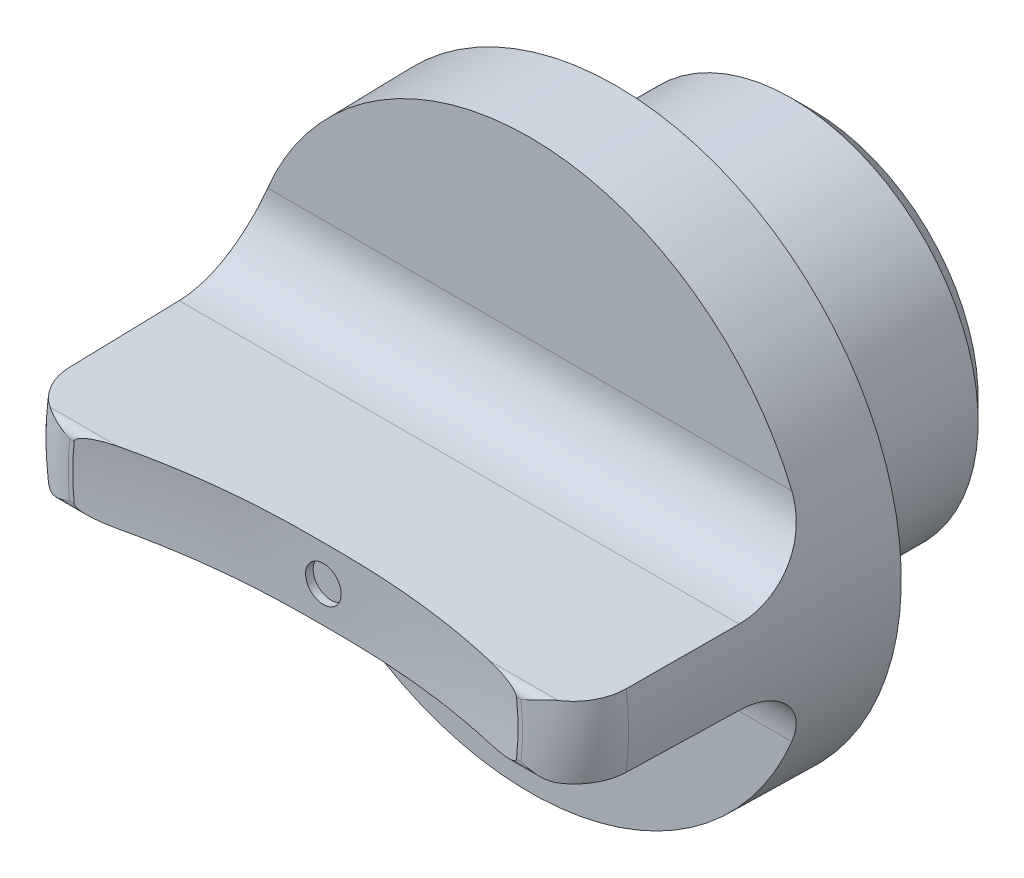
ISO-10303-21;
HEADER;
FILE_DESCRIPTION(('STEP AP214'),'2;1');
FILE_NAME('part.step','',(''),(''),'','','');
FILE_SCHEMA(('AUTOMOTIVE_DESIGN { 1 0 10303 214 1 1 1 1 }'));
ENDSEC;
DATA;
#1=APPLICATION_CONTEXT('core data for automotive mechanical design processes');
#2=APPLICATION_PROTOCOL_DEFINITION('international standard','automotive_design',2000,#1);
#3=PRODUCT_CONTEXT('',#1,'mechanical');
#4=PRODUCT('Part','Part','',(#3));
#5=PRODUCT_RELATED_PRODUCT_CATEGORY('part','',(#4));
#6=PRODUCT_DEFINITION_FORMATION('','',#4);
#7=PRODUCT_DEFINITION_CONTEXT('part definition',#1,'design');
#8=PRODUCT_DEFINITION('design','',#6,#7);
#9=PRODUCT_DEFINITION_SHAPE('','',#8);
#10=(LENGTH_UNIT() NAMED_UNIT(*) SI_UNIT(.MILLI.,.METRE.));
#11=(NAMED_UNIT(*) PLANE_ANGLE_UNIT() SI_UNIT($,.RADIAN.));
#12=(NAMED_UNIT(*) SI_UNIT($,.STERADIAN.) SOLID_ANGLE_UNIT());
#13=UNCERTAINTY_MEASURE_WITH_UNIT(LENGTH_MEASURE(1.E-05),#10,'distance_accuracy_value','');
#14=(GEOMETRIC_REPRESENTATION_CONTEXT(3) GLOBAL_UNCERTAINTY_ASSIGNED_CONTEXT((#13)) GLOBAL_UNIT_ASSIGNED_CONTEXT((#10,
#11,#12)) REPRESENTATION_CONTEXT('',''));
#15=CARTESIAN_POINT('',(0.,0.,0.));
#16=DIRECTION('',(0.,0.,1.));
#17=DIRECTION('',(1.,0.,0.));
#18=AXIS2_PLACEMENT_3D('',#15,#16,#17);
#19=CARTESIAN_POINT('',(12.5,0.,18.));
#20=DIRECTION('',(0.,0.,-1.));
#21=DIRECTION('',(0.,1.,0.));
#22=AXIS2_PLACEMENT_3D('',#19,#20,#21);
#23=PLANE('',#22);
#24=CARTESIAN_POINT('',(0.,0.,18.));
#25=DIRECTION('',(0.,0.,-1.));
#26=DIRECTION('',(0.,1.,0.));
#27=AXIS2_PLACEMENT_3D('',#24,#25,#26);
#28=CIRCLE('',#27,12.750855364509);
#29=CARTESIAN_POINT('',(-12.661690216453,-1.50529511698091,18.));
#30=VERTEX_POINT('',#29);
#31=CARTESIAN_POINT('',(-12.661690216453,1.50529511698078,18.));
#32=VERTEX_POINT('',#31);
#33=EDGE_CURVE('E328',#30,#32,#28,.T.);
#34=ORIENTED_EDGE('',*,*,#33,.F.);
#35=DIRECTION('',(-1.,0.,0.));
#36=VECTOR('',#35,1.);
#37=CARTESIAN_POINT('',(32.,-1.50529511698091,18.));
#38=LINE('',#37,#36);
#39=CARTESIAN_POINT('',(-12.4090324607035,-1.50529511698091,18.));
#40=VERTEX_POINT('',#39);
#41=EDGE_CURVE('E345',#40,#30,#38,.T.);
#42=ORIENTED_EDGE('',*,*,#41,.F.);
#43=CARTESIAN_POINT('',(0.,0.,18.));
#44=DIRECTION('',(0.,0.,-1.));
#45=DIRECTION('',(0.,1.,0.));
#46=AXIS2_PLACEMENT_3D('',#43,#44,#45);
#47=CIRCLE('',#46,12.5);
#48=CARTESIAN_POINT('',(-12.4090324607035,1.50529511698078,18.));
#49=VERTEX_POINT('',#48);
#50=EDGE_CURVE('E332',#40,#49,#47,.T.);
#51=ORIENTED_EDGE('',*,*,#50,.T.);
#52=DIRECTION('',(-1.,0.,0.));
#53=VECTOR('',#52,1.);
#54=CARTESIAN_POINT('',(32.,1.50529511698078,18.));
#55=LINE('',#54,#53);
#56=EDGE_CURVE('E343',#49,#32,#55,.T.);
#57=ORIENTED_EDGE('',*,*,#56,.T.);
#58=EDGE_LOOP('',(#34,#42,#51,#57));
#59=FACE_BOUND('',#58,.T.);
#60=ADVANCED_FACE('F14',(#59),#23,.F.);
#61=CARTESIAN_POINT('',(12.661690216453,1.50529511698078,18.));
#62=VERTEX_POINT('',#61);
#63=CARTESIAN_POINT('',(12.4090324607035,1.50529511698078,18.));
#64=VERTEX_POINT('',#63);
#65=EDGE_CURVE('E384',#62,#64,#55,.T.);
#66=ORIENTED_EDGE('',*,*,#65,.T.);
#67=CARTESIAN_POINT('',(12.4090324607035,-1.50529511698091,18.));
#68=VERTEX_POINT('',#67);
#69=EDGE_CURVE('E120',#64,#68,#47,.T.);
#70=ORIENTED_EDGE('',*,*,#69,.T.);
#71=CARTESIAN_POINT('',(12.661690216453,-1.50529511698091,18.));
#72=VERTEX_POINT('',#71);
#73=EDGE_CURVE('E389',#72,#68,#38,.T.);
#74=ORIENTED_EDGE('',*,*,#73,.F.);
#75=EDGE_CURVE('E329',#62,#72,#28,.T.);
#76=ORIENTED_EDGE('',*,*,#75,.F.);
#77=EDGE_LOOP('',(#66,#70,#74,#76));
#78=FACE_BOUND('',#77,.T.);
#79=ADVANCED_FACE('F436',(#78),#23,.F.);
#80=CARTESIAN_POINT('',(0.,0.,15.));
#81=DIRECTION('',(0.,0.,-1.));
#82=DIRECTION('',(0.,1.,0.));
#83=AXIS2_PLACEMENT_3D('',#80,#81,#82);
#84=TOROIDAL_SURFACE('',#83,12.750855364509,3.);
#85=CARTESIAN_POINT('',(0.,0.,15.0497396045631));
#86=DIRECTION('',(0.,0.,-1.));
#87=DIRECTION('',(0.,1.,0.));
#88=AXIS2_PLACEMENT_3D('',#85,#86,#87);
#89=CIRCLE('',#88,15.7504429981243);
#90=CARTESIAN_POINT('',(-15.6188931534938,-2.03141115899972,15.0497396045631));
#91=VERTEX_POINT('',#90);
#92=CARTESIAN_POINT('',(-15.6188931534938,2.03141115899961,15.0497396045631));
#93=VERTEX_POINT('',#92);
#94=EDGE_CURVE('E324',#91,#93,#89,.T.);
#95=ORIENTED_EDGE('',*,*,#94,.F.);
#96=CARTESIAN_POINT('',(-15.6182369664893,-2.03272050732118,14.9267604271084));
#97=CARTESIAN_POINT('',(-15.6204235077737,-2.03182899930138,15.0104943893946));
#98=CARTESIAN_POINT('',(-15.6190569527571,-2.03093654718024,15.094317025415));
#99=CARTESIAN_POINT('',(-15.6092646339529,-2.02915608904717,15.2615447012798));
#100=CARTESIAN_POINT('',(-15.6008392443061,-2.0282680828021,15.3449497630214));
#101=CARTESIAN_POINT('',(-15.576990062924,-2.02650376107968,15.5106618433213));
#102=CARTESIAN_POINT('',(-15.5615742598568,-2.02562743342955,15.5929700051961));
#103=CARTESIAN_POINT('',(-15.5238758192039,-2.02389194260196,15.7559741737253));
#104=CARTESIAN_POINT('',(-15.5015932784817,-2.02303277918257,15.8366702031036));
#105=CARTESIAN_POINT('',(-15.4246364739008,-2.02048953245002,16.0755420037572));
#106=CARTESIAN_POINT('',(-15.3598401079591,-2.01883874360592,16.2305906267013));
#107=CARTESIAN_POINT('',(-15.2051964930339,-2.01567648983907,16.5276020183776));
#108=CARTESIAN_POINT('',(-15.1153421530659,-2.01416506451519,16.6695610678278));
#109=CARTESIAN_POINT('',(-14.9129181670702,-2.01131904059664,16.9368709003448));
#110=CARTESIAN_POINT('',(-14.8002835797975,-2.00998496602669,17.0621724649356));
#111=CARTESIAN_POINT('',(-14.5557738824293,-2.00753683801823,17.2921103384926));
#112=CARTESIAN_POINT('',(-14.4239280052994,-2.0064224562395,17.3967774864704));
#113=CARTESIAN_POINT('',(-14.2473028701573,-2.0051691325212,17.5144946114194));
#114=CARTESIAN_POINT('',(-14.2095366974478,-2.00491389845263,17.5384672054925));
#115=CARTESIAN_POINT('',(-14.1330402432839,-2.00442190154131,17.5846775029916));
#116=CARTESIAN_POINT('',(-14.0943116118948,-2.00418510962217,17.6069179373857));
#117=CARTESIAN_POINT('',(-14.0550973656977,-2.00395743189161,17.6283023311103));
#118=B_SPLINE_CURVE_WITH_KNOTS('',3,(#96,#97,#98,#99,#100,#101,#102,#103,#104,#105,#106,#107,
#108,#109,#110,#111,#112,#113,#114,#115,#116,#117),.UNSPECIFIED.,.F.,.F.,(4,2,2,2,2,2,2,2,2,2,
4),(0.,0.251219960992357,0.502426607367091,0.753346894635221,1.00426364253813,1.50583031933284,
2.00753907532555,2.51069877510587,3.01310068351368,3.14727237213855,3.28122804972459),.UNSPECIFIED.);
#119=CARTESIAN_POINT('',(-14.2608208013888,-2.00526678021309,17.5053231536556));
#120=VERTEX_POINT('',#119);
#121=EDGE_CURVE('E221',#91,#120,#118,.T.);
#122=ORIENTED_EDGE('',*,*,#121,.T.);
#123=CARTESIAN_POINT('',(-12.661690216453,-1.50529511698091,18.0000000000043));
#124=CARTESIAN_POINT('',(-12.6650698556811,-1.50673456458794,17.9999999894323));
#125=CARTESIAN_POINT('',(-12.6684495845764,-1.5081741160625,17.9999937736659));
#126=CARTESIAN_POINT('',(-12.8277750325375,-1.57603806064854,17.9994080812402));
#127=CARTESIAN_POINT('',(-12.9838927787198,-1.64259650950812,17.9856169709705));
#128=CARTESIAN_POINT('',(-13.2946906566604,-1.76793306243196,17.9309246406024));
#129=CARTESIAN_POINT('',(-13.4493712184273,-1.82671356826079,17.8900318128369));
#130=CARTESIAN_POINT('',(-13.6583803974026,-1.89430279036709,17.8152854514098));
#131=CARTESIAN_POINT('',(-13.7144245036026,-1.91123479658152,17.7932808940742));
#132=CARTESIAN_POINT('',(-13.825807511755,-1.94175166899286,17.7455777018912));
#133=CARTESIAN_POINT('',(-13.8811470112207,-1.95533957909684,17.7198824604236));
#134=CARTESIAN_POINT('',(-13.9913023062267,-1.97834485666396,17.6646914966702));
#135=CARTESIAN_POINT('',(-14.0461122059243,-1.98773400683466,17.635171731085));
#136=CARTESIAN_POINT('',(-14.127437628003,-1.99769539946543,17.5883054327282));
#137=CARTESIAN_POINT('',(-14.154438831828,-2.00032967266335,17.5722254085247));
#138=CARTESIAN_POINT('',(-14.2080753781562,-2.00402648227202,17.5392613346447));
#139=CARTESIAN_POINT('',(-14.2347104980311,-2.00508810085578,17.5223768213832));
#140=CARTESIAN_POINT('',(-14.2611270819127,-2.0052688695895,17.5051231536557));
#141=B_SPLINE_CURVE_WITH_KNOTS('',3,(#123,#124,#125,#126,#127,#128,#129,#130,#131,#132,#133,
#134,#135,#136,#137,#138,#139,#140),.UNSPECIFIED.,.F.,.F.,(4,2,2,2,2,2,2,2,4),(0.,
0.0110206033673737,0.519515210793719,1.02785243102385,1.21532803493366,1.40263235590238,
1.59117718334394,1.68574184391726,1.78036167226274),.UNSPECIFIED.);
#142=EDGE_CURVE('E23',#30,#120,#141,.T.);
#143=ORIENTED_EDGE('',*,*,#142,.F.);
#144=ORIENTED_EDGE('',*,*,#33,.T.);
#145=CARTESIAN_POINT('',(-14.2611270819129,2.00526886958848,17.5051231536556));
#146=CARTESIAN_POINT('',(-14.2169923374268,2.00494307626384,17.5339613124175));
#147=CARTESIAN_POINT('',(-14.172260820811,2.00219836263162,17.5617405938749));
#148=CARTESIAN_POINT('',(-14.0819417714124,1.99266377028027,17.6149195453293));
#149=CARTESIAN_POINT('',(-14.0363562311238,1.98588238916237,17.6403240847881));
#150=CARTESIAN_POINT('',(-13.9447414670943,1.96910717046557,17.6884766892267));
#151=CARTESIAN_POINT('',(-13.8987162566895,1.95913187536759,17.7112390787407));
#152=CARTESIAN_POINT('',(-13.8061019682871,1.93653380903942,17.7542084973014));
#153=CARTESIAN_POINT('',(-13.7595125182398,1.92390919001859,17.7744137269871));
#154=CARTESIAN_POINT('',(-13.5737207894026,1.86959132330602,17.8494273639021));
#155=CARTESIAN_POINT('',(-13.4327291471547,1.81959342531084,17.8940643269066));
#156=CARTESIAN_POINT('',(-13.1489568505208,1.71045494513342,17.9604315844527));
#157=CARTESIAN_POINT('',(-13.0061736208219,1.65129936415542,17.9821238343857));
#158=CARTESIAN_POINT('',(-12.7994417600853,1.5639739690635,17.997295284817));
#159=CARTESIAN_POINT('',(-12.7356368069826,1.53679191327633,17.9997465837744));
#160=CARTESIAN_POINT('',(-12.6684496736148,1.50817416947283,17.9999937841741));
#161=CARTESIAN_POINT('',(-12.6650699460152,1.50673461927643,18.0000000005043));
#162=CARTESIAN_POINT('',(-12.661690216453,1.50529511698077,18.0000000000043));
#163=B_SPLINE_CURVE_WITH_KNOTS('',3,(#145,#146,#147,#148,#149,#150,#151,#152,#153,#154,#155,
#156,#157,#158,#159,#160,#161,#162),.UNSPECIFIED.,.F.,.F.,(4,2,2,2,2,2,2,2,4),(0.,
0.158003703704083,0.315675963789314,0.472448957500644,0.629331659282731,1.09501244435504,
1.56146416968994,1.76952757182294,1.78054817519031),.UNSPECIFIED.);
#164=CARTESIAN_POINT('',(-14.2608208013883,2.00526678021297,17.5053231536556));
#165=VERTEX_POINT('',#164);
#166=EDGE_CURVE('E236',#165,#32,#163,.T.);
#167=ORIENTED_EDGE('',*,*,#166,.F.);
#168=CARTESIAN_POINT('',(-14.0550973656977,2.0039574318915,17.6283023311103));
#169=CARTESIAN_POINT('',(-14.1293487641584,2.0043883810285,17.5878258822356));
#170=CARTESIAN_POINT('',(-14.2018951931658,2.00485257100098,17.544227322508));
#171=CARTESIAN_POINT('',(-14.3430806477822,2.00584401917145,17.4511065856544));
#172=CARTESIAN_POINT('',(-14.4117196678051,2.0063712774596,17.4015844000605));
#173=CARTESIAN_POINT('',(-14.5445452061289,2.00748504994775,17.2969744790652));
#174=CARTESIAN_POINT('',(-14.6087348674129,2.00807152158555,17.2418907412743));
#175=CARTESIAN_POINT('',(-14.7322336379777,2.00929970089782,17.126535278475));
#176=CARTESIAN_POINT('',(-14.7915428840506,2.00994140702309,17.0662636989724));
#177=CARTESIAN_POINT('',(-14.9615583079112,2.01194390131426,16.8781815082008));
#178=CARTESIAN_POINT('',(-15.0643884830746,2.01338237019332,16.7430748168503));
#179=CARTESIAN_POINT('',(-15.2457017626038,2.01642326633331,16.4574618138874));
#180=CARTESIAN_POINT('',(-15.3241805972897,2.01802572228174,16.3069528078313));
#181=CARTESIAN_POINT('',(-15.4541771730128,2.02134013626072,15.9956499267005));
#182=CARTESIAN_POINT('',(-15.5058339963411,2.02305147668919,15.8349140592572));
#183=CARTESIAN_POINT('',(-15.5811979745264,2.02654091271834,15.507172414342));
#184=CARTESIAN_POINT('',(-15.6049519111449,2.02831889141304,15.3401776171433));
#185=CARTESIAN_POINT('',(-15.6167929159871,2.03053897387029,15.1316586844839));
#186=CARTESIAN_POINT('',(-15.618268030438,2.03097552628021,15.0906559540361));
#187=CARTESIAN_POINT('',(-15.6195203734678,2.03184824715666,15.0086865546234));
#188=CARTESIAN_POINT('',(-15.6193001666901,2.03228441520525,14.9677199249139));
#189=CARTESIAN_POINT('',(-15.6182369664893,2.03272050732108,14.9267604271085));
#190=B_SPLINE_CURVE_WITH_KNOTS('',3,(#168,#169,#170,#171,#172,#173,#174,#175,#176,#177,#178,
#179,#180,#181,#182,#183,#184,#185,#186,#187,#188,#189),.UNSPECIFIED.,.F.,.F.,(4,2,2,2,2,2,2,2,
2,2,4),(0.,0.253626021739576,0.50725240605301,0.760697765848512,1.01413601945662,
1.52087555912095,2.02770389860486,2.53187721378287,3.03520402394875,3.15827870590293,
3.2811672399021),.UNSPECIFIED.);
#191=EDGE_CURVE('E182',#165,#93,#190,.T.);
#192=ORIENTED_EDGE('',*,*,#191,.T.);
#193=EDGE_LOOP('',(#95,#122,#143,#144,#167,#192));
#194=FACE_BOUND('',#193,.T.);
#195=ADVANCED_FACE('F206',(#194),#84,.T.);
#196=CARTESIAN_POINT('',(0.,0.,15.0497396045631));
#197=DIRECTION('',(0.,0.,-1.));
#198=DIRECTION('',(0.,1.,0.));
#199=AXIS2_PLACEMENT_3D('',#196,#197,#198);
#200=CONICAL_SURFACE('',#199,15.7504429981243,0.0165806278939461);
#201=CARTESIAN_POINT('',(0.,0.,0.));
#202=DIRECTION('',(0.,0.,-1.));
#203=DIRECTION('',(0.,1.,0.));
#204=AXIS2_PLACEMENT_3D('',#201,#202,#203);
#205=CIRCLE('',#204,16.);
#206=CARTESIAN_POINT('',(0.,16.,0.));
#207=VERTEX_POINT('',#206);
#208=EDGE_CURVE('E321',#207,#207,#205,.T.);
#209=ORIENTED_EDGE('',*,*,#208,.F.);
#210=EDGE_LOOP('',(#209));
#211=FACE_BOUND('',#210,.T.);
#212=CARTESIAN_POINT('',(-15.6188900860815,-2.03140902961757,15.0499396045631));
#213=CARTESIAN_POINT('',(-15.6348475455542,-2.04248664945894,14.0094856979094));
#214=CARTESIAN_POINT('',(-15.6507974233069,-2.05356427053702,12.9690316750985));
#215=CARTESIAN_POINT('',(-15.6826820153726,-2.07571951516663,10.8881233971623));
#216=CARTESIAN_POINT('',(-15.6986167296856,-2.08679713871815,9.84766914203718));
#217=CARTESIAN_POINT('',(-15.7145438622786,-2.09787476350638,8.80721477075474));
#218=B_SPLINE_CURVE_WITH_KNOTS('',3,(#212,#213,#214,#215,#216,#217),.UNSPECIFIED.,.F.,.F.,(4,2,
4),(0.,3.12190569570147,6.24381139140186),.UNSPECIFIED.);
#219=CARTESIAN_POINT('',(-15.7145408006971,-2.09787263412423,8.80741477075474));
#220=VERTEX_POINT('',#219);
#221=EDGE_CURVE('E401',#91,#220,#218,.T.);
#222=ORIENTED_EDGE('',*,*,#221,.F.);
#223=ORIENTED_EDGE('',*,*,#94,.T.);
#224=CARTESIAN_POINT('',(-15.7145438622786,2.09787476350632,8.80721477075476));
#225=CARTESIAN_POINT('',(-15.6986167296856,2.08679713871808,9.8476691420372));
#226=CARTESIAN_POINT('',(-15.6826820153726,2.07571951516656,10.8881233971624));
#227=CARTESIAN_POINT('',(-15.6507974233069,2.05356427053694,12.9690316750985));
#228=CARTESIAN_POINT('',(-15.6348475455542,2.04248664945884,14.0094856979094));
#229=CARTESIAN_POINT('',(-15.6188900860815,2.03140902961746,15.0499396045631));
#230=B_SPLINE_CURVE_WITH_KNOTS('',3,(#224,#225,#226,#227,#228,#229),.UNSPECIFIED.,.F.,.F.,(4,2,
4),(0.,3.12190569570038,6.24381139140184),.UNSPECIFIED.);
#231=CARTESIAN_POINT('',(-15.7145408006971,2.09787263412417,8.80741477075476));
#232=VERTEX_POINT('',#231);
#233=EDGE_CURVE('E134',#232,#93,#230,.T.);
#234=ORIENTED_EDGE('',*,*,#233,.F.);
#235=CARTESIAN_POINT('',(-14.7054137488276,6.09784593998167,4.85000000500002));
#236=CARTESIAN_POINT('',(-14.7504274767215,5.98932353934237,4.8499838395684));
#237=CARTESIAN_POINT('',(-14.7941579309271,5.88024749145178,4.85440562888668));
#238=CARTESIAN_POINT('',(-14.8788359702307,5.66171469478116,4.87231648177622));
#239=CARTESIAN_POINT('',(-14.919782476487,5.55225781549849,4.88580903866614));
#240=CARTESIAN_POINT('',(-14.9987001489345,5.33361158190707,4.9220801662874));
#241=CARTESIAN_POINT('',(-15.0366667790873,5.22442287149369,4.94487257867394));
#242=CARTESIAN_POINT('',(-15.1093790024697,5.00735240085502,4.99983229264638));
#243=CARTESIAN_POINT('',(-15.1441250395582,4.89947046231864,5.03199829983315));
#244=CARTESIAN_POINT('',(-15.2103709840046,4.68562291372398,5.10580202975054));
#245=CARTESIAN_POINT('',(-15.241862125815,4.57966308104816,5.14746440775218));
#246=CARTESIAN_POINT('',(-15.3014502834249,4.3708586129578,5.24011694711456));
#247=CARTESIAN_POINT('',(-15.3295460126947,4.26801516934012,5.29111062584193));
#248=CARTESIAN_POINT('',(-15.3822984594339,4.06659979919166,5.40209454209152));
#249=CARTESIAN_POINT('',(-15.4069605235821,3.96802140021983,5.46207048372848));
#250=CARTESIAN_POINT('',(-15.4529804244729,3.77586303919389,5.59075178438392));
#251=CARTESIAN_POINT('',(-15.4743370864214,3.68228486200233,5.65946023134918));
#252=CARTESIAN_POINT('',(-15.5128868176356,3.50555564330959,5.80151229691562));
#253=CARTESIAN_POINT('',(-15.5302337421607,3.42211769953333,5.87445763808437));
#254=CARTESIAN_POINT('',(-15.562211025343,3.26129136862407,6.02734023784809));
#255=CARTESIAN_POINT('',(-15.576840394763,3.18390519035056,6.10728002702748));
#256=CARTESIAN_POINT('',(-15.6035575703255,3.03587383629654,6.27358036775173));
#257=CARTESIAN_POINT('',(-15.6156453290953,2.96522878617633,6.35994103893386));
#258=CARTESIAN_POINT('',(-15.6374809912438,2.83126306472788,6.53845941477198));
#259=CARTESIAN_POINT('',(-15.6472280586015,2.76794501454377,6.63061917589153));
#260=CARTESIAN_POINT('',(-15.6729509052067,2.59196854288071,6.91136506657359));
#261=CARTESIAN_POINT('',(-15.685894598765,2.49046364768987,7.10740049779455));
#262=CARTESIAN_POINT('',(-15.7050471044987,2.32107521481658,7.51360756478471));
#263=CARTESIAN_POINT('',(-15.7112600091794,2.25317126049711,7.72377052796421));
#264=CARTESIAN_POINT('',(-15.7169988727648,2.16961626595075,8.08055738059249));
#265=CARTESIAN_POINT('',(-15.7180666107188,2.14408398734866,8.22491505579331));
#266=CARTESIAN_POINT('',(-15.7179435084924,2.10898510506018,8.51534690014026));
#267=CARTESIAN_POINT('',(-15.716755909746,2.09939562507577,8.66141830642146));
#268=CARTESIAN_POINT('',(-15.7145377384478,2.09787050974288,8.80761477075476));
#269=B_SPLINE_CURVE_WITH_KNOTS('',3,(#235,#236,#237,#238,#239,#240,#241,#242,#243,#244,#245,
#246,#247,#248,#249,#250,#251,#252,#253,#254,#255,#256,#257,#258,#259,#260,#261,#262,#263,#264,
#265,#266,#267,#268),.UNSPECIFIED.,.F.,.F.,(4,2,2,2,2,2,2,2,2,2,2,2,2,2,2,2,4),(0.,
0.352400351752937,0.704936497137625,1.05799927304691,1.41101331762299,1.76495454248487,
2.11902945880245,2.47254671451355,2.82618932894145,3.1623116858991,3.49855615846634,
3.83480689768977,4.17117755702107,4.83123725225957,5.49089538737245,5.9298563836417,
6.3681869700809),.UNSPECIFIED.);
#270=CARTESIAN_POINT('',(-14.705496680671,6.09764593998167,4.85));
#271=VERTEX_POINT('',#270);
#272=EDGE_CURVE('E125',#271,#232,#269,.T.);
#273=ORIENTED_EDGE('',*,*,#272,.F.);
#274=CARTESIAN_POINT('',(0.,0.,4.85));
#275=DIRECTION('',(0.,0.,1.));
#276=DIRECTION('',(0.,-1.,0.));
#277=AXIS2_PLACEMENT_3D('',#274,#275,#276);
#278=CIRCLE('',#277,15.919576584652);
#279=CARTESIAN_POINT('',(14.705496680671,6.09764593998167,4.85));
#280=VERTEX_POINT('',#279);
#281=EDGE_CURVE('E114',#280,#271,#278,.T.);
#282=ORIENTED_EDGE('',*,*,#281,.F.);
#283=CARTESIAN_POINT('',(15.7145377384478,2.09787050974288,8.80761477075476));
#284=CARTESIAN_POINT('',(15.7162317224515,2.09903520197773,8.69653673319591));
#285=CARTESIAN_POINT('',(15.7173212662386,2.10485137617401,8.58549959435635));
#286=CARTESIAN_POINT('',(15.7182221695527,2.12569415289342,8.36429005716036));
#287=CARTESIAN_POINT('',(15.7180335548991,2.14072056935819,8.25411764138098));
#288=CARTESIAN_POINT('',(15.7163093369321,2.17988168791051,8.03546988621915));
#289=CARTESIAN_POINT('',(15.7147743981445,2.20401189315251,7.92699373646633));
#290=CARTESIAN_POINT('',(15.7102419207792,2.26120074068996,7.7124541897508));
#291=CARTESIAN_POINT('',(15.7072444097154,2.29425921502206,7.60639074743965));
#292=CARTESIAN_POINT('',(15.6996390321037,2.36907726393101,7.3973808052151));
#293=CARTESIAN_POINT('',(15.6950304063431,2.4108409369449,7.29443579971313));
#294=CARTESIAN_POINT('',(15.6840278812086,2.50275875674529,7.09241480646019));
#295=CARTESIAN_POINT('',(15.6776333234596,2.55291599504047,6.99334026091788));
#296=CARTESIAN_POINT('',(15.6628724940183,2.6611859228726,6.79987247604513));
#297=CARTESIAN_POINT('',(15.6545074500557,2.71929364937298,6.70547636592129));
#298=CARTESIAN_POINT('',(15.6355989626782,2.84304880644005,6.52194250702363));
#299=CARTESIAN_POINT('',(15.625054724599,2.90869898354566,6.43280669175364));
#300=CARTESIAN_POINT('',(15.6016541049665,3.04660319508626,6.26094432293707));
#301=CARTESIAN_POINT('',(15.5888108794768,3.11881855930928,6.1781849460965));
#302=CARTESIAN_POINT('',(15.5605815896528,3.26959478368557,6.01907376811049));
#303=CARTESIAN_POINT('',(15.5451945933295,3.34815796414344,5.94272433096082));
#304=CARTESIAN_POINT('',(15.5117240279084,3.51091029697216,5.79701414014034));
#305=CARTESIAN_POINT('',(15.4936418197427,3.59509659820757,5.72764988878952));
#306=CARTESIAN_POINT('',(15.4546338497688,3.76845477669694,5.59627893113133));
#307=CARTESIAN_POINT('',(15.4337070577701,3.85762845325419,5.5342749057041));
#308=CARTESIAN_POINT('',(15.3889969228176,4.03987110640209,5.41820841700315));
#309=CARTESIAN_POINT('',(15.3652236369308,4.13292565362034,5.36411941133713));
#310=CARTESIAN_POINT('',(15.3147061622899,4.3224825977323,5.2638744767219));
#311=CARTESIAN_POINT('',(15.2879608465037,4.41898629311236,5.21772157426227));
#312=CARTESIAN_POINT('',(15.2315020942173,4.61464458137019,5.13354386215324));
#313=CARTESIAN_POINT('',(15.2017884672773,4.713799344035,5.09551957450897));
#314=CARTESIAN_POINT('',(15.1394464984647,4.91398960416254,5.02767841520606));
#315=CARTESIAN_POINT('',(15.106817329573,5.01502562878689,4.99786388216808));
#316=CARTESIAN_POINT('',(15.0182624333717,5.27932459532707,4.93101335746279));
#317=CARTESIAN_POINT('',(14.96011153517,5.44352741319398,4.90038899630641));
#318=CARTESIAN_POINT('',(14.8680520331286,5.6895586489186,4.87001251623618));
#319=CARTESIAN_POINT('',(14.8365905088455,5.77144993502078,4.86248016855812));
#320=CARTESIAN_POINT('',(14.7721321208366,5.93493418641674,4.85247323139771));
#321=CARTESIAN_POINT('',(14.739135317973,6.01652716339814,4.84999844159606));
#322=CARTESIAN_POINT('',(14.7054137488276,6.09784593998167,4.85000000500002));
#323=B_SPLINE_CURVE_WITH_KNOTS('',3,(#283,#284,#285,#286,#287,#288,#289,#290,#291,#292,#293,
#294,#295,#296,#297,#298,#299,#300,#301,#302,#303,#304,#305,#306,#307,#308,#309,#310,#311,#312,
#313,#314,#315,#316,#317,#318,#319,#320,#321,#322),.UNSPECIFIED.,.F.,.F.,(4,2,2,2,2,2,2,2,2,2,2,
2,2,2,2,2,2,2,2,4),(0.,0.333191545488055,0.666376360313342,0.999396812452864,1.33241100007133,
1.66558232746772,1.99887663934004,2.3319638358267,2.66517271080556,2.99653243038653,
3.32801382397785,3.65932840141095,3.990763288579,4.32105992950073,4.65148225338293,
4.98192579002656,5.31246335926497,5.84145391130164,6.10547407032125,6.36948377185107),.UNSPECIFIED.);
#324=CARTESIAN_POINT('',(15.7145408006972,2.09787263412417,8.80741477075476));
#325=VERTEX_POINT('',#324);
#326=EDGE_CURVE('E119',#325,#280,#323,.T.);
#327=ORIENTED_EDGE('',*,*,#326,.F.);
#328=CARTESIAN_POINT('',(15.6188900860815,2.03140902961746,15.0499396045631));
#329=CARTESIAN_POINT('',(15.6348475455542,2.04248664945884,14.0094856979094));
#330=CARTESIAN_POINT('',(15.6507974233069,2.05356427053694,12.9690316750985));
#331=CARTESIAN_POINT('',(15.6826820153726,2.07571951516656,10.8881233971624));
#332=CARTESIAN_POINT('',(15.6986167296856,2.08679713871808,9.8476691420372));
#333=CARTESIAN_POINT('',(15.7145438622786,2.09787476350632,8.80721477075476));
#334=B_SPLINE_CURVE_WITH_KNOTS('',3,(#328,#329,#330,#331,#332,#333),.UNSPECIFIED.,.F.,.F.,(4,2,
4),(0.,3.12190569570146,6.24381139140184),.UNSPECIFIED.);
#335=CARTESIAN_POINT('',(15.6188931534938,2.03141115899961,15.0497396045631));
#336=VERTEX_POINT('',#335);
#337=EDGE_CURVE('E136',#336,#325,#334,.T.);
#338=ORIENTED_EDGE('',*,*,#337,.F.);
#339=CARTESIAN_POINT('',(15.6188931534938,-2.03141115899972,15.0497396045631));
#340=VERTEX_POINT('',#339);
#341=EDGE_CURVE('E325',#336,#340,#89,.T.);
#342=ORIENTED_EDGE('',*,*,#341,.T.);
#343=CARTESIAN_POINT('',(15.7145438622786,-2.09787476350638,8.80721477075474));
#344=CARTESIAN_POINT('',(15.6986167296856,-2.08679713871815,9.84766914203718));
#345=CARTESIAN_POINT('',(15.6826820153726,-2.07571951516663,10.8881233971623));
#346=CARTESIAN_POINT('',(15.6507974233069,-2.05356427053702,12.9690316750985));
#347=CARTESIAN_POINT('',(15.6348475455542,-2.04248664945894,14.0094856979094));
#348=CARTESIAN_POINT('',(15.6188900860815,-2.03140902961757,15.0499396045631));
#349=B_SPLINE_CURVE_WITH_KNOTS('',3,(#343,#344,#345,#346,#347,#348),.UNSPECIFIED.,.F.,.F.,(4,2,
4),(0.,3.12190569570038,6.24381139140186),.UNSPECIFIED.);
#350=CARTESIAN_POINT('',(15.7145408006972,-2.09787263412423,8.80741477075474));
#351=VERTEX_POINT('',#350);
#352=EDGE_CURVE('E428',#351,#340,#349,.T.);
#353=ORIENTED_EDGE('',*,*,#352,.F.);
#354=CARTESIAN_POINT('',(14.7054137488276,-6.09784593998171,4.85000000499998));
#355=CARTESIAN_POINT('',(14.7504274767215,-5.98932353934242,4.84998383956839));
#356=CARTESIAN_POINT('',(14.7941579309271,-5.88024749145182,4.85440562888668));
#357=CARTESIAN_POINT('',(14.8788359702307,-5.66171469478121,4.87231648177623));
#358=CARTESIAN_POINT('',(14.919782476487,-5.55225781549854,4.88580903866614));
#359=CARTESIAN_POINT('',(14.9987001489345,-5.33361158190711,4.92208016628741));
#360=CARTESIAN_POINT('',(15.0366667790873,-5.22442287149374,4.94487257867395));
#361=CARTESIAN_POINT('',(15.1093790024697,-5.00735240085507,4.99983229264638));
#362=CARTESIAN_POINT('',(15.1441250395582,-4.89947046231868,5.03199829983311));
#363=CARTESIAN_POINT('',(15.2103709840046,-4.68562291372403,5.1058020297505));
#364=CARTESIAN_POINT('',(15.241862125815,-4.57966308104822,5.14746440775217));
#365=CARTESIAN_POINT('',(15.3014502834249,-4.37085861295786,5.24011694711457));
#366=CARTESIAN_POINT('',(15.3295460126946,-4.26801516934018,5.29111062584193));
#367=CARTESIAN_POINT('',(15.3822984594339,-4.06659979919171,5.40209454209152));
#368=CARTESIAN_POINT('',(15.4069605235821,-3.96802140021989,5.46207048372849));
#369=CARTESIAN_POINT('',(15.4529804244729,-3.77586303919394,5.59075178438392));
#370=CARTESIAN_POINT('',(15.4743370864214,-3.68228486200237,5.65946023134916));
#371=CARTESIAN_POINT('',(15.5128868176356,-3.50555564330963,5.80151229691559));
#372=CARTESIAN_POINT('',(15.5302337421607,-3.42211769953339,5.87445763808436));
#373=CARTESIAN_POINT('',(15.562211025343,-3.26129136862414,6.02734023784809));
#374=CARTESIAN_POINT('',(15.576840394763,-3.18390519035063,6.10728002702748));
#375=CARTESIAN_POINT('',(15.6035575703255,-3.03587383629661,6.27358036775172));
#376=CARTESIAN_POINT('',(15.6156453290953,-2.96522878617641,6.35994103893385));
#377=CARTESIAN_POINT('',(15.6374809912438,-2.83126306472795,6.53845941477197));
#378=CARTESIAN_POINT('',(15.6472280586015,-2.76794501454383,6.63061917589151));
#379=CARTESIAN_POINT('',(15.6729509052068,-2.59196854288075,6.91136506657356));
#380=CARTESIAN_POINT('',(15.685894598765,-2.49046364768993,7.10740049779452));
#381=CARTESIAN_POINT('',(15.7050471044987,-2.32107521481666,7.5136075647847));
#382=CARTESIAN_POINT('',(15.7112600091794,-2.25317126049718,7.72377052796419));
#383=CARTESIAN_POINT('',(15.7169988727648,-2.16961626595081,8.08055738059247));
#384=CARTESIAN_POINT('',(15.7180666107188,-2.14408398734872,8.22491505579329));
#385=CARTESIAN_POINT('',(15.7179435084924,-2.10898510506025,8.51534690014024));
#386=CARTESIAN_POINT('',(15.716755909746,-2.09939562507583,8.66141830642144));
#387=CARTESIAN_POINT('',(15.7145377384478,-2.09787050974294,8.80761477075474));
#388=B_SPLINE_CURVE_WITH_KNOTS('',3,(#354,#355,#356,#357,#358,#359,#360,#361,#362,#363,#364,
#365,#366,#367,#368,#369,#370,#371,#372,#373,#374,#375,#376,#377,#378,#379,#380,#381,#382,#383,
#384,#385,#386,#387),.UNSPECIFIED.,.F.,.F.,(4,2,2,2,2,2,2,2,2,2,2,2,2,2,2,2,4),(0.,
0.352400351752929,0.70493649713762,1.05799927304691,1.41101331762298,1.76495454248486,
2.11902945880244,2.47254671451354,2.82618932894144,3.16231168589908,3.49855615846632,
3.83480689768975,4.17117755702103,4.83123725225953,5.49089538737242,5.92985638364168,
6.36818697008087),.UNSPECIFIED.);
#389=CARTESIAN_POINT('',(14.705496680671,-6.09764593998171,4.85));
#390=VERTEX_POINT('',#389);
#391=EDGE_CURVE('E423',#390,#351,#388,.T.);
#392=ORIENTED_EDGE('',*,*,#391,.F.);
#393=CARTESIAN_POINT('',(0.,0.,4.85));
#394=DIRECTION('',(0.,0.,1.));
#395=DIRECTION('',(0.,-1.,0.));
#396=AXIS2_PLACEMENT_3D('',#393,#394,#395);
#397=CIRCLE('',#396,15.919576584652);
#398=CARTESIAN_POINT('',(-14.705496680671,-6.09764593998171,4.85));
#399=VERTEX_POINT('',#398);
#400=EDGE_CURVE('E403',#399,#390,#397,.T.);
#401=ORIENTED_EDGE('',*,*,#400,.F.);
#402=CARTESIAN_POINT('',(-15.7145377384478,-2.09787050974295,8.80761477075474));
#403=CARTESIAN_POINT('',(-15.7162317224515,-2.09903520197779,8.69653673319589));
#404=CARTESIAN_POINT('',(-15.7173212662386,-2.10485137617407,8.58549959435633));
#405=CARTESIAN_POINT('',(-15.7182221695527,-2.12569415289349,8.36429005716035));
#406=CARTESIAN_POINT('',(-15.7180335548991,-2.14072056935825,8.25411764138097));
#407=CARTESIAN_POINT('',(-15.7163093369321,-2.17988168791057,8.03546988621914));
#408=CARTESIAN_POINT('',(-15.7147743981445,-2.20401189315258,7.92699373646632));
#409=CARTESIAN_POINT('',(-15.7102419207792,-2.26120074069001,7.71245418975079));
#410=CARTESIAN_POINT('',(-15.7072444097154,-2.29425921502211,7.60639074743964));
#411=CARTESIAN_POINT('',(-15.6996390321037,-2.36907726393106,7.39738080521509));
#412=CARTESIAN_POINT('',(-15.6950304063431,-2.41084093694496,7.29443579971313));
#413=CARTESIAN_POINT('',(-15.6840278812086,-2.50275875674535,7.09241480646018));
#414=CARTESIAN_POINT('',(-15.6776333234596,-2.55291599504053,6.99334026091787));
#415=CARTESIAN_POINT('',(-15.6628724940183,-2.66118592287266,6.79987247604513));
#416=CARTESIAN_POINT('',(-15.6545074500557,-2.71929364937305,6.70547636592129));
#417=CARTESIAN_POINT('',(-15.6355989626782,-2.8430488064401,6.52194250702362));
#418=CARTESIAN_POINT('',(-15.625054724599,-2.90869898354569,6.43280669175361));
#419=CARTESIAN_POINT('',(-15.6016541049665,-3.04660319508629,6.26094432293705));
#420=CARTESIAN_POINT('',(-15.5888108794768,-3.11881855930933,6.1781849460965));
#421=CARTESIAN_POINT('',(-15.5605815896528,-3.26959478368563,6.01907376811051));
#422=CARTESIAN_POINT('',(-15.5451945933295,-3.34815796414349,5.94272433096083));
#423=CARTESIAN_POINT('',(-15.5117240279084,-3.51091029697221,5.79701414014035));
#424=CARTESIAN_POINT('',(-15.4936418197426,-3.59509659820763,5.72764988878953));
#425=CARTESIAN_POINT('',(-15.4546338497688,-3.76845477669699,5.59627893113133));
#426=CARTESIAN_POINT('',(-15.4337070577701,-3.85762845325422,5.53427490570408));
#427=CARTESIAN_POINT('',(-15.3889969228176,-4.03987110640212,5.41820841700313));
#428=CARTESIAN_POINT('',(-15.3652236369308,-4.13292565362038,5.36411941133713));
#429=CARTESIAN_POINT('',(-15.3147061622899,-4.32248259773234,5.26387447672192));
#430=CARTESIAN_POINT('',(-15.2879608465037,-4.41898629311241,5.21772157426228));
#431=CARTESIAN_POINT('',(-15.2315020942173,-4.61464458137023,5.13354386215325));
#432=CARTESIAN_POINT('',(-15.2017884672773,-4.71379934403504,5.09551957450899));
#433=CARTESIAN_POINT('',(-15.1394464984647,-4.91398960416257,5.02767841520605));
#434=CARTESIAN_POINT('',(-15.106817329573,-5.01502562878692,4.99786388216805));
#435=CARTESIAN_POINT('',(-15.0182624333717,-5.27932459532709,4.93101335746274));
#436=CARTESIAN_POINT('',(-14.96011153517,-5.44352741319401,4.9003889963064));
#437=CARTESIAN_POINT('',(-14.8680520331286,-5.68955864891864,4.87001251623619));
#438=CARTESIAN_POINT('',(-14.8365905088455,-5.77144993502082,4.86248016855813));
#439=CARTESIAN_POINT('',(-14.7721321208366,-5.93493418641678,4.8524732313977));
#440=CARTESIAN_POINT('',(-14.739135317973,-6.01652716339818,4.84999844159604));
#441=CARTESIAN_POINT('',(-14.7054137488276,-6.09784593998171,4.85000000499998));
#442=B_SPLINE_CURVE_WITH_KNOTS('',3,(#402,#403,#404,#405,#406,#407,#408,#409,#410,#411,#412,
#413,#414,#415,#416,#417,#418,#419,#420,#421,#422,#423,#424,#425,#426,#427,#428,#429,#430,#431,
#432,#433,#434,#435,#436,#437,#438,#439,#440,#441),.UNSPECIFIED.,.F.,.F.,(4,2,2,2,2,2,2,2,2,2,2,
2,2,2,2,2,2,2,2,4),(0.,0.333191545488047,0.666376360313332,0.999396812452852,1.33241100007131,
1.6655823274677,1.99887663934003,2.33196383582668,2.66517271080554,2.99653243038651,
3.32801382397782,3.65932840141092,3.99076328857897,4.3210599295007,4.6514822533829,
4.98192579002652,5.31246335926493,5.84145391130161,6.10547407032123,6.36948377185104),.UNSPECIFIED.);
#443=EDGE_CURVE('E402',#220,#399,#442,.T.);
#444=ORIENTED_EDGE('',*,*,#443,.F.);
#445=EDGE_LOOP('',(#222,#223,#234,#273,#282,#327,#338,#342,#353,#392,#401,#444));
#446=FACE_BOUND('',#445,.T.);
#447=ADVANCED_FACE('F132',(#211,#446),#200,.T.);
#448=CARTESIAN_POINT('',(0.,-1.97009882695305E-13,56.4258730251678));
#449=DIRECTION('',(0.,0.,-1.));
#450=DIRECTION('',(0.,1.,0.));
#451=AXIS2_PLACEMENT_3D('',#448,#449,#450);
#452=DEGENERATE_TOROIDAL_SURFACE('',#451,1.38909174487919,40.,.T.);
#453=ORIENTED_EDGE('',*,*,#69,.F.);
#454=CARTESIAN_POINT('',(9.45064017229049,1.95835947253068,17.2884989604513));
#455=CARTESIAN_POINT('',(9.53185457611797,1.96634013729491,17.305629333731));
#456=CARTESIAN_POINT('',(9.61312075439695,1.97327878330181,17.3229919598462));
#457=CARTESIAN_POINT('',(9.77570667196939,1.98512151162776,17.3581725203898));
#458=CARTESIAN_POINT('',(9.85702641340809,1.99002550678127,17.37599047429));
#459=CARTESIAN_POINT('',(10.0198333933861,1.99785595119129,17.4121089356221));
#460=CARTESIAN_POINT('',(10.1013206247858,2.00077822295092,17.4304103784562));
#461=CARTESIAN_POINT('',(10.26424353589,2.00458169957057,17.4674462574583));
#462=CARTESIAN_POINT('',(10.34567921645,2.00546293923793,17.4861806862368));
#463=CARTESIAN_POINT('',(10.5084606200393,2.00507477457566,17.5240680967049));
#464=CARTESIAN_POINT('',(10.5898063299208,2.00380508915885,17.5432211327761));
#465=CARTESIAN_POINT('',(10.7523334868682,1.99892423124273,17.5819189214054));
#466=CARTESIAN_POINT('',(10.833514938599,1.99531312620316,17.6014636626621));
#467=CARTESIAN_POINT('',(10.995594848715,1.98546209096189,17.6409019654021));
#468=CARTESIAN_POINT('',(11.0764934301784,1.97922350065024,17.6607953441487));
#469=CARTESIAN_POINT('',(11.2379047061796,1.96366966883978,17.7008830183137));
#470=CARTESIAN_POINT('',(11.318417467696,1.95435498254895,17.7210772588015));
#471=CARTESIAN_POINT('',(11.4917418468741,1.93019072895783,17.764945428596));
#472=CARTESIAN_POINT('',(11.5844593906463,1.91469389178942,17.7886589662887));
#473=CARTESIAN_POINT('',(11.7224834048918,1.88619250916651,17.8242603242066));
#474=CARTESIAN_POINT('',(11.7683334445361,1.87581102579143,17.8361371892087));
#475=CARTESIAN_POINT('',(11.8594909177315,1.85285278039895,17.8598300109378));
#476=CARTESIAN_POINT('',(11.9047985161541,1.84027670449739,17.8716459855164));
#477=CARTESIAN_POINT('',(11.9947072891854,1.81221490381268,17.8951412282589));
#478=CARTESIAN_POINT('',(12.039306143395,1.79672116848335,17.9068200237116));
#479=CARTESIAN_POINT('',(12.1269014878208,1.76173294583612,17.9297474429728));
#480=CARTESIAN_POINT('',(12.1699027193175,1.74225163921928,17.9409973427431));
#481=CARTESIAN_POINT('',(12.242089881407,1.70270704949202,17.9597600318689));
#482=CARTESIAN_POINT('',(12.2719666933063,1.68410474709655,17.9674854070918));
#483=CARTESIAN_POINT('',(12.3139598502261,1.65183954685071,17.9781757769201));
#484=CARTESIAN_POINT('',(12.3275514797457,1.64028463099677,17.9816053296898));
#485=CARTESIAN_POINT('',(12.3530194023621,1.61526689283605,17.9879275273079));
#486=CARTESIAN_POINT('',(12.3649011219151,1.60181038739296,17.9908218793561));
#487=CARTESIAN_POINT('',(12.3805039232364,1.57977504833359,17.9944778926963));
#488=CARTESIAN_POINT('',(12.385359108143,1.57206506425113,17.9955872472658));
#489=CARTESIAN_POINT('',(12.3939935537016,1.55605409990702,17.9974822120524));
#490=CARTESIAN_POINT('',(12.3977771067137,1.54775564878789,17.9982691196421));
#491=CARTESIAN_POINT('',(12.4039757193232,1.53055949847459,17.9994349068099));
#492=CARTESIAN_POINT('',(12.4063823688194,1.52165848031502,17.9998112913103));
#493=CARTESIAN_POINT('',(12.4095530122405,1.50343289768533,18.0000836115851));
#494=CARTESIAN_POINT('',(12.4102922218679,1.49410401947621,17.9999723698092));
#495=CARTESIAN_POINT('',(12.4100368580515,1.48476384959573,17.9995782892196));
#496=B_SPLINE_CURVE_WITH_KNOTS('',3,(#454,#455,#456,#457,#458,#459,#460,#461,#462,#463,#464,
#465,#466,#467,#468,#469,#470,#471,#472,#473,#474,#475,#476,#477,#478,#479,#480,#481,#482,#483,
#484,#485,#486,#487,#488,#489,#490,#491,#492,#493,#494,#495),.UNSPECIFIED.,.F.,.F.,(4,2,2,2,2,2,
2,2,2,2,2,2,2,2,2,2,2,2,2,2,4),(0.,0.250143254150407,0.500297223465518,0.750976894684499,
1.00165229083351,1.25236044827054,1.50306138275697,1.75363462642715,2.00416266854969,
2.29478941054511,2.44021460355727,2.58559441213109,2.73137934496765,2.87668995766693,
2.98431854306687,3.03871126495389,3.09292737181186,3.12039587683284,3.14775275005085,
3.17527498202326,3.20320367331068),.UNSPECIFIED.);
#497=CARTESIAN_POINT('',(10.427923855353,2.00526678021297,17.5053231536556));
#498=VERTEX_POINT('',#497);
#499=EDGE_CURVE('E355',#64,#498,#496,.F.);
#500=ORIENTED_EDGE('',*,*,#499,.T.);
#501=CARTESIAN_POINT('',(-10.6575962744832,2.00469001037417,17.5594956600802));
#502=CARTESIAN_POINT('',(-10.2194052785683,2.00580498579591,17.4547727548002));
#503=CARTESIAN_POINT('',(-9.77945004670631,2.00684129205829,17.3574387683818));
#504=CARTESIAN_POINT('',(-8.89653294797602,2.00875601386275,17.1776005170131));
#505=CARTESIAN_POINT('',(-8.45357117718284,2.00963443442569,17.0950957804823));
#506=CARTESIAN_POINT('',(-7.56648071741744,2.01123048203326,16.9451886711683));
#507=CARTESIAN_POINT('',(-7.12235962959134,2.01194858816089,16.8777413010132));
#508=CARTESIAN_POINT('',(-6.2321261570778,2.01322760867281,16.7576106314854));
#509=CARTESIAN_POINT('',(-5.78601377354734,2.01378852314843,16.7049273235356));
#510=CARTESIAN_POINT('',(-4.89692532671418,2.01474970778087,16.6146490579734));
#511=CARTESIAN_POINT('',(-4.45396447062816,2.0151515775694,16.5769038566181));
#512=CARTESIAN_POINT('',(-3.56710553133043,2.01580682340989,16.5153605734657));
#513=CARTESIAN_POINT('',(-3.12320751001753,2.01606020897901,16.491561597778));
#514=CARTESIAN_POINT('',(-2.45676955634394,2.01633894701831,16.465381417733));
#515=CARTESIAN_POINT('',(-2.23440240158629,2.01641498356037,16.4582397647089));
#516=CARTESIAN_POINT('',(-1.78959527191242,2.01653704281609,16.4467754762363));
#517=CARTESIAN_POINT('',(-1.56715529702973,2.01658306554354,16.4424528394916));
#518=CARTESIAN_POINT('',(-1.1222206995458,2.01665108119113,16.4360645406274));
#519=CARTESIAN_POINT('',(-0.899726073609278,2.01667307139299,16.4339991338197));
#520=CARTESIAN_POINT('',(-0.454727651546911,2.01670101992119,16.4313740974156));
#521=CARTESIAN_POINT('',(-0.232223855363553,2.01670697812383,16.4308144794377));
#522=CARTESIAN_POINT('',(0.21318389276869,2.01670734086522,16.4307804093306));
#523=CARTESIAN_POINT('',(0.436087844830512,2.0167017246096,16.4313079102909));
#524=CARTESIAN_POINT('',(0.881886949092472,2.01667461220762,16.43385441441));
#525=CARTESIAN_POINT('',(1.10478210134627,2.01665311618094,16.4358734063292));
#526=CARTESIAN_POINT('',(1.55051858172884,2.01658619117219,16.4421592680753));
#527=CARTESIAN_POINT('',(1.77335991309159,2.01654076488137,16.446425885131));
#528=CARTESIAN_POINT('',(2.21897056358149,2.01641990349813,16.4577776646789));
#529=CARTESIAN_POINT('',(2.44173988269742,2.01634446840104,16.4648628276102));
#530=CARTESIAN_POINT('',(3.10938519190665,2.01606743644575,16.490882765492));
#531=CARTESIAN_POINT('',(3.55408962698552,2.01581505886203,16.5145870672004));
#532=CARTESIAN_POINT('',(4.44256190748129,2.01516135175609,16.575985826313));
#533=CARTESIAN_POINT('',(4.88632969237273,2.01476001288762,16.6136811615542));
#534=CARTESIAN_POINT('',(5.77704896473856,2.01379935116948,16.703910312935));
#535=CARTESIAN_POINT('',(6.2239851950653,2.01323841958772,16.7565952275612));
#536=CARTESIAN_POINT('',(7.11586189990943,2.01195879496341,16.8767826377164));
#537=CARTESIAN_POINT('',(7.56080237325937,2.01124010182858,16.944285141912));
#538=CARTESIAN_POINT('',(8.44952854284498,2.009642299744,17.0943570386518));
#539=CARTESIAN_POINT('',(8.89330660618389,2.00876270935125,17.1769716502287));
#540=CARTESIAN_POINT('',(9.77784549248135,2.00684507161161,17.3570837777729));
#541=CARTESIAN_POINT('',(10.2186062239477,2.00580701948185,17.4545817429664));
#542=CARTESIAN_POINT('',(10.6575962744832,2.00469001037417,17.5594956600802));
#543=B_SPLINE_CURVE_WITH_KNOTS('',3,(#501,#502,#503,#504,#505,#506,#507,#508,#509,#510,#511,
#512,#513,#514,#515,#516,#517,#518,#519,#520,#521,#522,#523,#524,#525,#526,#527,#528,#529,#530,
#531,#532,#533,#534,#535,#536,#537,#538,#539,#540,#541,#542),.UNSPECIFIED.,.F.,.F.,(4,2,2,2,2,2,
2,2,2,2,2,2,2,2,2,2,2,2,2,2,4),(0.,1.35153090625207,2.7030188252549,4.05041222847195,
5.39780484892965,6.73127862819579,8.06466692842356,8.73209696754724,9.39952669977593,
10.0670319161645,10.734542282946,11.4032529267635,12.0719585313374,12.740588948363,
13.4092194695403,14.7450076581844,16.0808796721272,17.4307260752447,18.7805732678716,
20.1345276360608,21.4885228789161),.UNSPECIFIED.);
#544=CARTESIAN_POINT('',(-10.4279238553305,2.00526678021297,17.5053231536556));
#545=VERTEX_POINT('',#544);
#546=EDGE_CURVE('E195',#545,#498,#543,.T.);
#547=ORIENTED_EDGE('',*,*,#546,.F.);
#548=CARTESIAN_POINT('',(-10.4270646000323,2.00526886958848,17.5051231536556));
#549=CARTESIAN_POINT('',(-10.5081648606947,2.00505788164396,17.5239983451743));
#550=CARTESIAN_POINT('',(-10.5892207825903,2.0038094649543,17.5430830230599));
#551=CARTESIAN_POINT('',(-10.7512254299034,1.99897063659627,17.581653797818));
#552=CARTESIAN_POINT('',(-10.83217404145,1.99537859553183,17.6011401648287));
#553=CARTESIAN_POINT('',(-10.9942912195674,1.98555714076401,17.6405820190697));
#554=CARTESIAN_POINT('',(-11.0754584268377,1.97931287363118,17.6605395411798));
#555=CARTESIAN_POINT('',(-11.2373943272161,1.96372909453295,17.7007550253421));
#556=CARTESIAN_POINT('',(-11.3181631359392,1.95439054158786,17.7210128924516));
#557=CARTESIAN_POINT('',(-11.4917692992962,1.93018678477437,17.7649523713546));
#558=CARTESIAN_POINT('',(-11.5845140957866,1.91468477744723,17.7886729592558));
#559=CARTESIAN_POINT('',(-11.7225510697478,1.88617745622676,17.8242778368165));
#560=CARTESIAN_POINT('',(-11.7683874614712,1.87579811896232,17.8361512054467));
#561=CARTESIAN_POINT('',(-11.859517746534,1.85284532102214,17.8598370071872));
#562=CARTESIAN_POINT('',(-11.9048118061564,1.84027255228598,17.8716494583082));
#563=CARTESIAN_POINT('',(-11.9947081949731,1.81221462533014,17.895141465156));
#564=CARTESIAN_POINT('',(-12.0393079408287,1.79672054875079,17.9068204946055));
#565=CARTESIAN_POINT('',(-12.1269032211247,1.76173215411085,17.9297478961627));
#566=CARTESIAN_POINT('',(-12.1699035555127,1.74225117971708,17.9409975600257));
#567=CARTESIAN_POINT('',(-12.242089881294,1.70270705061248,17.9597600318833));
#568=CARTESIAN_POINT('',(-12.2719666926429,1.6841047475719,17.967485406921));
#569=CARTESIAN_POINT('',(-12.3139599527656,1.65183946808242,17.978175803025));
#570=CARTESIAN_POINT('',(-12.3275516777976,1.64028446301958,17.9816053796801));
#571=CARTESIAN_POINT('',(-12.3530195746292,1.61526669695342,17.9879275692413));
#572=CARTESIAN_POINT('',(-12.3649011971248,1.60181028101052,17.9908218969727));
#573=CARTESIAN_POINT('',(-12.3805039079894,1.57977506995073,17.9944778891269));
#574=CARTESIAN_POINT('',(-12.3853590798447,1.57206510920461,17.9955872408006));
#575=CARTESIAN_POINT('',(-12.3939935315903,1.55605414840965,17.9974822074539));
#576=CARTESIAN_POINT('',(-12.3977770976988,1.54775567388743,17.9982691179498));
#577=CARTESIAN_POINT('',(-12.4039757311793,1.53055946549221,17.9994349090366));
#578=CARTESIAN_POINT('',(-12.406382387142,1.52165841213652,17.9998112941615));
#579=CARTESIAN_POINT('',(-12.4095530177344,1.50343282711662,18.0000836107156));
#580=CARTESIAN_POINT('',(-12.4102922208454,1.49410398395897,17.9999723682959));
#581=CARTESIAN_POINT('',(-12.4100368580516,1.48476384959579,17.9995782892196));
#582=B_SPLINE_CURVE_WITH_KNOTS('',3,(#548,#549,#550,#551,#552,#553,#554,#555,#556,#557,#558,
#559,#560,#561,#562,#563,#564,#565,#566,#567,#568,#569,#570,#571,#572,#573,#574,#575,#576,#577,
#578,#579,#580,#581),.UNSPECIFIED.,.F.,.F.,(4,2,2,2,2,2,2,2,2,2,2,2,2,2,2,2,4),(0.,
0.249807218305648,0.499788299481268,0.751188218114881,1.00251029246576,1.29322269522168,
1.43860524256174,1.58394201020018,1.72972987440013,1.87503755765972,1.98266614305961,
2.03705925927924,2.09127497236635,2.11874339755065,2.14610035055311,2.1736226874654,
2.20155127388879),.UNSPECIFIED.);
#583=EDGE_CURVE('E273',#545,#49,#582,.T.);
#584=ORIENTED_EDGE('',*,*,#583,.T.);
#585=ORIENTED_EDGE('',*,*,#50,.F.);
#586=CARTESIAN_POINT('',(-9.45064017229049,-1.9583594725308,17.2884989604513));
#587=CARTESIAN_POINT('',(-9.53185457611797,-1.96634013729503,17.3056293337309));
#588=CARTESIAN_POINT('',(-9.61312075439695,-1.97327878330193,17.3229919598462));
#589=CARTESIAN_POINT('',(-9.77570667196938,-1.98512151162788,17.3581725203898));
#590=CARTESIAN_POINT('',(-9.85702641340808,-1.99002550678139,17.37599047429));
#591=CARTESIAN_POINT('',(-10.0198333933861,-1.99785595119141,17.412108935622));
#592=CARTESIAN_POINT('',(-10.1013206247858,-2.00077822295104,17.4304103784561));
#593=CARTESIAN_POINT('',(-10.26424353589,-2.00458169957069,17.4674462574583));
#594=CARTESIAN_POINT('',(-10.34567921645,-2.00546293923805,17.4861806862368));
#595=CARTESIAN_POINT('',(-10.5084606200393,-2.00507477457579,17.5240680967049));
#596=CARTESIAN_POINT('',(-10.5898063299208,-2.00380508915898,17.5432211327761));
#597=CARTESIAN_POINT('',(-10.7523334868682,-1.99892423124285,17.5819189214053));
#598=CARTESIAN_POINT('',(-10.833514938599,-1.99531312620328,17.601463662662));
#599=CARTESIAN_POINT('',(-10.995594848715,-1.98546209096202,17.6409019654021));
#600=CARTESIAN_POINT('',(-11.0764934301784,-1.97922350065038,17.6607953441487));
#601=CARTESIAN_POINT('',(-11.2379047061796,-1.96366966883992,17.7008830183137));
#602=CARTESIAN_POINT('',(-11.318417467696,-1.95435498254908,17.7210772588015));
#603=CARTESIAN_POINT('',(-11.4917418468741,-1.93019072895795,17.764945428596));
#604=CARTESIAN_POINT('',(-11.5844593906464,-1.91469389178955,17.7886589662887));
#605=CARTESIAN_POINT('',(-11.7224834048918,-1.88619250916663,17.8242603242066));
#606=CARTESIAN_POINT('',(-11.7683334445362,-1.87581102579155,17.8361371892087));
#607=CARTESIAN_POINT('',(-11.8594909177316,-1.85285278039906,17.8598300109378));
#608=CARTESIAN_POINT('',(-11.9047985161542,-1.84027670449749,17.8716459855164));
#609=CARTESIAN_POINT('',(-11.9947072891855,-1.81221490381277,17.8951412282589));
#610=CARTESIAN_POINT('',(-12.0393061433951,-1.79672116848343,17.9068200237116));
#611=CARTESIAN_POINT('',(-12.126901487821,-1.76173294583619,17.9297474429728));
#612=CARTESIAN_POINT('',(-12.1699027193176,-1.74225163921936,17.9409973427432));
#613=CARTESIAN_POINT('',(-12.2420898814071,-1.70270704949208,17.959760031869));
#614=CARTESIAN_POINT('',(-12.2719666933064,-1.68410474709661,17.9674854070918));
#615=CARTESIAN_POINT('',(-12.3139598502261,-1.65183954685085,17.9781757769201));
#616=CARTESIAN_POINT('',(-12.3275514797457,-1.64028463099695,17.9816053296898));
#617=CARTESIAN_POINT('',(-12.353019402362,-1.61526689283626,17.9879275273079));
#618=CARTESIAN_POINT('',(-12.364901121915,-1.60181038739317,17.9908218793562));
#619=CARTESIAN_POINT('',(-12.3805039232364,-1.57977504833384,17.9944778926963));
#620=CARTESIAN_POINT('',(-12.3853591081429,-1.57206506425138,17.9955872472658));
#621=CARTESIAN_POINT('',(-12.3939935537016,-1.55605409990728,17.9974822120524));
#622=CARTESIAN_POINT('',(-12.3977771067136,-1.54775564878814,17.9982691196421));
#623=CARTESIAN_POINT('',(-12.4039757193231,-1.53055949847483,17.9994349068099));
#624=CARTESIAN_POINT('',(-12.4063823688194,-1.52165848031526,17.9998112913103));
#625=CARTESIAN_POINT('',(-12.4095530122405,-1.50343289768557,18.0000836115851));
#626=CARTESIAN_POINT('',(-12.4102922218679,-1.49410401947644,17.9999723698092));
#627=CARTESIAN_POINT('',(-12.4100368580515,-1.48476384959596,17.9995782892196));
#628=B_SPLINE_CURVE_WITH_KNOTS('',3,(#586,#587,#588,#589,#590,#591,#592,#593,#594,#595,#596,
#597,#598,#599,#600,#601,#602,#603,#604,#605,#606,#607,#608,#609,#610,#611,#612,#613,#614,#615,
#616,#617,#618,#619,#620,#621,#622,#623,#624,#625,#626,#627),.UNSPECIFIED.,.F.,.F.,(4,2,2,2,2,2,
2,2,2,2,2,2,2,2,2,2,2,2,2,2,4),(0.,0.250143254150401,0.500297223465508,0.750976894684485,
1.00165229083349,1.25236044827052,1.50306138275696,1.75363462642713,2.00416266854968,
2.29478941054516,2.44021460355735,2.58559441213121,2.73137934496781,2.87668995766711,
2.98431854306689,3.03871126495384,3.09292737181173,3.12039587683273,3.14775275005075,
3.17527498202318,3.20320367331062),.UNSPECIFIED.);
#629=CARTESIAN_POINT('',(-10.4279238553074,-2.00526678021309,17.5053231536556));
#630=VERTEX_POINT('',#629);
#631=EDGE_CURVE('E265',#40,#630,#628,.F.);
#632=ORIENTED_EDGE('',*,*,#631,.T.);
#633=CARTESIAN_POINT('',(10.6575962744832,-2.00469001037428,17.5594956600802));
#634=CARTESIAN_POINT('',(10.2194052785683,-2.00580498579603,17.4547727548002));
#635=CARTESIAN_POINT('',(9.77945004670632,-2.00684129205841,17.3574387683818));
#636=CARTESIAN_POINT('',(8.89653294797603,-2.00875601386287,17.1776005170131));
#637=CARTESIAN_POINT('',(8.45357117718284,-2.00963443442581,17.0950957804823));
#638=CARTESIAN_POINT('',(7.56648071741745,-2.01123048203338,16.9451886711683));
#639=CARTESIAN_POINT('',(7.12235962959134,-2.011948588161,16.8777413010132));
#640=CARTESIAN_POINT('',(6.2321261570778,-2.01322760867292,16.7576106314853));
#641=CARTESIAN_POINT('',(5.78601377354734,-2.01378852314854,16.7049273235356));
#642=CARTESIAN_POINT('',(4.89692532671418,-2.01474970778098,16.6146490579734));
#643=CARTESIAN_POINT('',(4.45396447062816,-2.01515157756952,16.5769038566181));
#644=CARTESIAN_POINT('',(3.56710553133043,-2.01580682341,16.5153605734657));
#645=CARTESIAN_POINT('',(3.12320751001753,-2.01606020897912,16.491561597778));
#646=CARTESIAN_POINT('',(2.45676955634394,-2.01633894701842,16.465381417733));
#647=CARTESIAN_POINT('',(2.23440240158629,-2.01641498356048,16.4582397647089));
#648=CARTESIAN_POINT('',(1.78959527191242,-2.0165370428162,16.4467754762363));
#649=CARTESIAN_POINT('',(1.56715529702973,-2.01658306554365,16.4424528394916));
#650=CARTESIAN_POINT('',(1.1222206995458,-2.01665108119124,16.4360645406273));
#651=CARTESIAN_POINT('',(0.899726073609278,-2.0166730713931,16.4339991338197));
#652=CARTESIAN_POINT('',(0.454727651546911,-2.0167010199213,16.4313740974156));
#653=CARTESIAN_POINT('',(0.232223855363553,-2.01670697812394,16.4308144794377));
#654=CARTESIAN_POINT('',(-0.21318389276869,-2.01670734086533,16.4307804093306));
#655=CARTESIAN_POINT('',(-0.436087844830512,-2.01670172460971,16.4313079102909));
#656=CARTESIAN_POINT('',(-0.881886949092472,-2.01667461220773,16.4338544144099));
#657=CARTESIAN_POINT('',(-1.10478210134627,-2.01665311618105,16.4358734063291));
#658=CARTESIAN_POINT('',(-1.55051858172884,-2.0165861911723,16.4421592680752));
#659=CARTESIAN_POINT('',(-1.77335991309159,-2.01654076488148,16.446425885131));
#660=CARTESIAN_POINT('',(-2.21897056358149,-2.01641990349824,16.4577776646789));
#661=CARTESIAN_POINT('',(-2.44173988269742,-2.01634446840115,16.4648628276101));
#662=CARTESIAN_POINT('',(-3.10938519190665,-2.01606743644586,16.490882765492));
#663=CARTESIAN_POINT('',(-3.55408962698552,-2.01581505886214,16.5145870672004));
#664=CARTESIAN_POINT('',(-4.44256190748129,-2.0151613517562,16.575985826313));
#665=CARTESIAN_POINT('',(-4.88632969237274,-2.01476001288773,16.6136811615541));
#666=CARTESIAN_POINT('',(-5.77704896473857,-2.0137993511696,16.7039103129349));
#667=CARTESIAN_POINT('',(-6.2239851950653,-2.01323841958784,16.7565952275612));
#668=CARTESIAN_POINT('',(-7.11586189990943,-2.01195879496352,16.8767826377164));
#669=CARTESIAN_POINT('',(-7.56080237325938,-2.01124010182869,16.9442851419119));
#670=CARTESIAN_POINT('',(-8.44952854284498,-2.00964229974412,17.0943570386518));
#671=CARTESIAN_POINT('',(-8.89330660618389,-2.00876270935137,17.1769716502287));
#672=CARTESIAN_POINT('',(-9.77784549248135,-2.00684507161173,17.3570837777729));
#673=CARTESIAN_POINT('',(-10.2186062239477,-2.00580701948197,17.4545817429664));
#674=CARTESIAN_POINT('',(-10.6575962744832,-2.00469001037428,17.5594956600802));
#675=B_SPLINE_CURVE_WITH_KNOTS('',3,(#633,#634,#635,#636,#637,#638,#639,#640,#641,#642,#643,
#644,#645,#646,#647,#648,#649,#650,#651,#652,#653,#654,#655,#656,#657,#658,#659,#660,#661,#662,
#663,#664,#665,#666,#667,#668,#669,#670,#671,#672,#673,#674),.UNSPECIFIED.,.F.,.F.,(4,2,2,2,2,2,
2,2,2,2,2,2,2,2,2,2,2,2,2,2,4),(0.,1.35153090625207,2.7030188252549,4.05041222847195,
5.39780484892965,6.7312786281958,8.06466692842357,8.73209696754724,9.39952669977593,
10.0670319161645,10.734542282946,11.4032529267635,12.0719585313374,12.740588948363,
13.4092194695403,14.7450076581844,16.0808796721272,17.4307260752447,18.7805732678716,
20.1345276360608,21.4885228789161),.UNSPECIFIED.);
#676=CARTESIAN_POINT('',(10.4279238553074,-2.00526678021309,17.5053231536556));
#677=VERTEX_POINT('',#676);
#678=EDGE_CURVE('E356',#677,#630,#675,.T.);
#679=ORIENTED_EDGE('',*,*,#678,.F.);
#680=CARTESIAN_POINT('',(10.4270646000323,-2.0052688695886,17.5051231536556));
#681=CARTESIAN_POINT('',(10.5081648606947,-2.00505788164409,17.5239983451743));
#682=CARTESIAN_POINT('',(10.5892207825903,-2.00380946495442,17.5430830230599));
#683=CARTESIAN_POINT('',(10.7512254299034,-1.9989706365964,17.581653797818));
#684=CARTESIAN_POINT('',(10.83217404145,-1.99537859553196,17.6011401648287));
#685=CARTESIAN_POINT('',(10.9942912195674,-1.98555714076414,17.6405820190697));
#686=CARTESIAN_POINT('',(11.0754584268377,-1.97931287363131,17.6605395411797));
#687=CARTESIAN_POINT('',(11.2373943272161,-1.96372909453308,17.7007550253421));
#688=CARTESIAN_POINT('',(11.3181631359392,-1.95439054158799,17.7210128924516));
#689=CARTESIAN_POINT('',(11.4917692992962,-1.93018678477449,17.7649523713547));
#690=CARTESIAN_POINT('',(11.5845140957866,-1.91468477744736,17.7886729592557));
#691=CARTESIAN_POINT('',(11.7225510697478,-1.8861774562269,17.8242778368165));
#692=CARTESIAN_POINT('',(11.7683874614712,-1.87579811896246,17.8361512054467));
#693=CARTESIAN_POINT('',(11.859517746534,-1.85284532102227,17.8598370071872));
#694=CARTESIAN_POINT('',(11.9048118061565,-1.84027255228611,17.8716494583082));
#695=CARTESIAN_POINT('',(11.9947081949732,-1.81221462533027,17.895141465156));
#696=CARTESIAN_POINT('',(12.0393079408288,-1.79672054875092,17.9068204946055));
#697=CARTESIAN_POINT('',(12.1269032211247,-1.76173215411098,17.9297478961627));
#698=CARTESIAN_POINT('',(12.1699035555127,-1.74225117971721,17.9409975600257));
#699=CARTESIAN_POINT('',(12.242089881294,-1.70270705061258,17.9597600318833));
#700=CARTESIAN_POINT('',(12.2719666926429,-1.68410474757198,17.967485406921));
#701=CARTESIAN_POINT('',(12.3139599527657,-1.65183946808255,17.978175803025));
#702=CARTESIAN_POINT('',(12.3275516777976,-1.64028446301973,17.9816053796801));
#703=CARTESIAN_POINT('',(12.3530195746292,-1.61526669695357,17.9879275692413));
#704=CARTESIAN_POINT('',(12.3649011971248,-1.60181028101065,17.9908218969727));
#705=CARTESIAN_POINT('',(12.3805039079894,-1.57977506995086,17.9944778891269));
#706=CARTESIAN_POINT('',(12.3853590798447,-1.57206510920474,17.9955872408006));
#707=CARTESIAN_POINT('',(12.3939935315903,-1.55605414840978,17.9974822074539));
#708=CARTESIAN_POINT('',(12.3977770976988,-1.54775567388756,17.9982691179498));
#709=CARTESIAN_POINT('',(12.4039757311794,-1.53055946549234,17.9994349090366));
#710=CARTESIAN_POINT('',(12.4063823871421,-1.52165841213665,17.9998112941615));
#711=CARTESIAN_POINT('',(12.4095530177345,-1.50343282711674,18.0000836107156));
#712=CARTESIAN_POINT('',(12.4102922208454,-1.49410398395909,17.9999723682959));
#713=CARTESIAN_POINT('',(12.4100368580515,-1.4847638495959,17.9995782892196));
#714=B_SPLINE_CURVE_WITH_KNOTS('',3,(#680,#681,#682,#683,#684,#685,#686,#687,#688,#689,#690,
#691,#692,#693,#694,#695,#696,#697,#698,#699,#700,#701,#702,#703,#704,#705,#706,#707,#708,#709,
#710,#711,#712,#713),.UNSPECIFIED.,.F.,.F.,(4,2,2,2,2,2,2,2,2,2,2,2,2,2,2,2,4),(0.,
0.24980721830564,0.499788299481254,0.751188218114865,1.00251029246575,1.29322269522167,
1.43860524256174,1.58394201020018,1.72972987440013,1.87503755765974,1.9826661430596,
2.03705925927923,2.09127497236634,2.11874339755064,2.14610035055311,2.17362268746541,
2.20155127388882),.UNSPECIFIED.);
#715=EDGE_CURVE('E272',#677,#68,#714,.T.);
#716=ORIENTED_EDGE('',*,*,#715,.T.);
#717=EDGE_LOOP('',(#453,#500,#547,#584,#585,#632,#679,#716));
#718=FACE_BOUND('',#717,.T.);
#719=CARTESIAN_POINT('',(0.,0.,16.4277654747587));
#720=DIRECTION('',(0.,0.,1.));
#721=DIRECTION('',(0.,-1.,0.));
#722=AXIS2_PLACEMENT_3D('',#719,#720,#721);
#723=CIRCLE('',#722,1.);
#724=CARTESIAN_POINT('',(0.,-1.00000000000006,16.4277654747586));
#725=VERTEX_POINT('',#724);
#726=EDGE_CURVE('E128',#725,#725,#723,.F.);
#727=ORIENTED_EDGE('',*,*,#726,.T.);
#728=EDGE_LOOP('',(#727));
#729=FACE_BOUND('',#728,.T.);
#730=ADVANCED_FACE('F16',(#718,#729),#452,.F.);
#731=CARTESIAN_POINT('',(12.661690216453,1.50529511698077,18.0000000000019));
#732=CARTESIAN_POINT('',(12.6650698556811,1.5067345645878,17.9999999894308));
#733=CARTESIAN_POINT('',(12.6684495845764,1.50817411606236,17.9999937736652));
#734=CARTESIAN_POINT('',(12.8277750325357,1.57603806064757,17.9994080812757));
#735=CARTESIAN_POINT('',(12.9838927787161,1.64259650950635,17.98561697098));
#736=CARTESIAN_POINT('',(13.2946906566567,1.76793306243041,17.9309246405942));
#737=CARTESIAN_POINT('',(13.4493712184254,1.82671356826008,17.8900318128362));
#738=CARTESIAN_POINT('',(13.6583803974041,1.89430279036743,17.8152854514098));
#739=CARTESIAN_POINT('',(13.7144245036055,1.91123479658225,17.7932808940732));
#740=CARTESIAN_POINT('',(13.8258075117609,1.94175166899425,17.7455777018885));
#741=CARTESIAN_POINT('',(13.8811470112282,1.95533957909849,17.7198824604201));
#742=CARTESIAN_POINT('',(13.9913023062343,1.9783448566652,17.6646914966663));
#743=CARTESIAN_POINT('',(14.0461122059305,1.98773400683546,17.6351717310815));
#744=CARTESIAN_POINT('',(14.127437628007,1.99769539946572,17.5883054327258));
#745=CARTESIAN_POINT('',(14.1544388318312,2.00032967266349,17.5722254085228));
#746=CARTESIAN_POINT('',(14.2080753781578,2.00402648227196,17.5392613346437));
#747=CARTESIAN_POINT('',(14.2347104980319,2.00508810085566,17.5223768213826));
#748=CARTESIAN_POINT('',(14.2611270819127,2.00526886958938,17.5051231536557));
#749=B_SPLINE_CURVE_WITH_KNOTS('',3,(#731,#732,#733,#734,#735,#736,#737,#738,#739,#740,#741,
#742,#743,#744,#745,#746,#747,#748),.UNSPECIFIED.,.F.,.F.,(4,2,2,2,2,2,2,2,4),(0.,
0.0110206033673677,0.519515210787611,1.02785243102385,1.21532803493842,1.40263235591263,
1.59117718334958,1.68574184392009,1.78036167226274),.UNSPECIFIED.);
#750=CARTESIAN_POINT('',(14.2608208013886,2.00526678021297,17.5053231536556));
#751=VERTEX_POINT('',#750);
#752=EDGE_CURVE('E229',#62,#751,#749,.T.);
#753=ORIENTED_EDGE('',*,*,#752,.F.);
#754=ORIENTED_EDGE('',*,*,#75,.T.);
#755=CARTESIAN_POINT('',(14.2611270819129,-2.0052688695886,17.5051231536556));
#756=CARTESIAN_POINT('',(14.2169923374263,-2.00494307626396,17.5339613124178));
#757=CARTESIAN_POINT('',(14.17226082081,-2.00219836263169,17.5617405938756));
#758=CARTESIAN_POINT('',(14.0819417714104,-1.99266377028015,17.6149195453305));
#759=CARTESIAN_POINT('',(14.0363562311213,-1.98588238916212,17.6403240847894));
#760=CARTESIAN_POINT('',(13.9447414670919,-1.9691071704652,17.6884766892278));
#761=CARTESIAN_POINT('',(13.8987162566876,-1.9591318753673,17.7112390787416));
#762=CARTESIAN_POINT('',(13.8061019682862,-1.93653380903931,17.7542084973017));
#763=CARTESIAN_POINT('',(13.7595125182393,-1.92390919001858,17.7744137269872));
#764=CARTESIAN_POINT('',(13.5737207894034,-1.86959132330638,17.8494273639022));
#765=CARTESIAN_POINT('',(13.4327291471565,-1.8195934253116,17.8940643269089));
#766=CARTESIAN_POINT('',(13.1489568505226,-1.71045494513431,17.9604315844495));
#767=CARTESIAN_POINT('',(13.0061736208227,-1.65129936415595,17.9821238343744));
#768=CARTESIAN_POINT('',(12.7994417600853,-1.56397396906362,17.997295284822));
#769=CARTESIAN_POINT('',(12.7356368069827,-1.53679191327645,17.9997465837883));
#770=CARTESIAN_POINT('',(12.6684496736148,-1.50817416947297,17.9999937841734));
#771=CARTESIAN_POINT('',(12.6650699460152,-1.50673461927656,18.0000000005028));
#772=CARTESIAN_POINT('',(12.661690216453,-1.50529511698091,18.0000000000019));
#773=B_SPLINE_CURVE_WITH_KNOTS('',3,(#755,#756,#757,#758,#759,#760,#761,#762,#763,#764,#765,
#766,#767,#768,#769,#770,#771,#772),.UNSPECIFIED.,.F.,.F.,(4,2,2,2,2,2,2,2,4),(0.,
0.15800370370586,0.3156759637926,0.47244895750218,0.62933165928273,1.09501244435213,
1.56146416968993,1.76952757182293,1.7805481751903),.UNSPECIFIED.);
#774=CARTESIAN_POINT('',(14.2608208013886,-2.00526678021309,17.5053231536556));
#775=VERTEX_POINT('',#774);
#776=EDGE_CURVE('E242',#775,#72,#773,.T.);
#777=ORIENTED_EDGE('',*,*,#776,.F.);
#778=CARTESIAN_POINT('',(14.0550973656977,-2.00395743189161,17.6283023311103));
#779=CARTESIAN_POINT('',(14.1293487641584,-2.00438838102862,17.5878258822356));
#780=CARTESIAN_POINT('',(14.2018951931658,-2.0048525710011,17.544227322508));
#781=CARTESIAN_POINT('',(14.3430806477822,-2.00584401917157,17.4511065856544));
#782=CARTESIAN_POINT('',(14.4117196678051,-2.00637127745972,17.4015844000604));
#783=CARTESIAN_POINT('',(14.5445452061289,-2.00748504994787,17.2969744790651));
#784=CARTESIAN_POINT('',(14.6087348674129,-2.00807152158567,17.2418907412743));
#785=CARTESIAN_POINT('',(14.7322336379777,-2.00929970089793,17.126535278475));
#786=CARTESIAN_POINT('',(14.7915428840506,-2.00994140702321,17.0662636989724));
#787=CARTESIAN_POINT('',(14.9615583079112,-2.01194390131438,16.8781815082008));
#788=CARTESIAN_POINT('',(15.0643884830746,-2.01338237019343,16.7430748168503));
#789=CARTESIAN_POINT('',(15.2457017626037,-2.01642326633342,16.4574618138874));
#790=CARTESIAN_POINT('',(15.3241805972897,-2.01802572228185,16.3069528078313));
#791=CARTESIAN_POINT('',(15.4541771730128,-2.02134013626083,15.9956499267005));
#792=CARTESIAN_POINT('',(15.5058339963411,-2.02305147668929,15.8349140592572));
#793=CARTESIAN_POINT('',(15.5811979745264,-2.02654091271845,15.507172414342));
#794=CARTESIAN_POINT('',(15.6049519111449,-2.02831889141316,15.3401776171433));
#795=CARTESIAN_POINT('',(15.6167929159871,-2.0305389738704,15.1316586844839));
#796=CARTESIAN_POINT('',(15.618268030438,-2.03097552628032,15.0906559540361));
#797=CARTESIAN_POINT('',(15.6195203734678,-2.03184824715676,15.0086865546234));
#798=CARTESIAN_POINT('',(15.6193001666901,-2.03228441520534,14.9677199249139));
#799=CARTESIAN_POINT('',(15.6182369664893,-2.03272050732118,14.9267604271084));
#800=B_SPLINE_CURVE_WITH_KNOTS('',3,(#778,#779,#780,#781,#782,#783,#784,#785,#786,#787,#788,
#789,#790,#791,#792,#793,#794,#795,#796,#797,#798,#799),.UNSPECIFIED.,.F.,.F.,(4,2,2,2,2,2,2,2,
2,2,4),(0.,0.253626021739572,0.50725240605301,0.760697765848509,1.01413601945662,
1.52087555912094,2.02770389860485,2.53187721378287,3.03520402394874,3.15827870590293,
3.28116723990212),.UNSPECIFIED.);
#801=EDGE_CURVE('E213',#775,#340,#800,.T.);
#802=ORIENTED_EDGE('',*,*,#801,.T.);
#803=ORIENTED_EDGE('',*,*,#341,.F.);
#804=CARTESIAN_POINT('',(15.6182369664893,2.03272050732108,14.9267604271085));
#805=CARTESIAN_POINT('',(15.6204235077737,2.03182899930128,15.0104943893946));
#806=CARTESIAN_POINT('',(15.6190569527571,2.03093654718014,15.094317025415));
#807=CARTESIAN_POINT('',(15.6092646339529,2.02915608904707,15.2615447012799));
#808=CARTESIAN_POINT('',(15.6008392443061,2.028268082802,15.3449497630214));
#809=CARTESIAN_POINT('',(15.576990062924,2.02650376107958,15.5106618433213));
#810=CARTESIAN_POINT('',(15.5615742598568,2.02562743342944,15.5929700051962));
#811=CARTESIAN_POINT('',(15.5238758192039,2.02389194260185,15.7559741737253));
#812=CARTESIAN_POINT('',(15.5015932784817,2.02303277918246,15.8366702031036));
#813=CARTESIAN_POINT('',(15.4246364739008,2.02048953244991,16.0755420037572));
#814=CARTESIAN_POINT('',(15.3598401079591,2.01883874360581,16.2305906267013));
#815=CARTESIAN_POINT('',(15.2051964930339,2.01567648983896,16.5276020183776));
#816=CARTESIAN_POINT('',(15.1153421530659,2.01416506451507,16.6695610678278));
#817=CARTESIAN_POINT('',(14.9129181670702,2.01131904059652,16.9368709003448));
#818=CARTESIAN_POINT('',(14.8002835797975,2.00998496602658,17.0621724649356));
#819=CARTESIAN_POINT('',(14.5557738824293,2.00753683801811,17.2921103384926));
#820=CARTESIAN_POINT('',(14.4239280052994,2.00642245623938,17.3967774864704));
#821=CARTESIAN_POINT('',(14.2473028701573,2.00516913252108,17.5144946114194));
#822=CARTESIAN_POINT('',(14.2095366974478,2.00491389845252,17.5384672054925));
#823=CARTESIAN_POINT('',(14.1330402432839,2.00442190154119,17.5846775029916));
#824=CARTESIAN_POINT('',(14.0943116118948,2.00418510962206,17.6069179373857));
#825=CARTESIAN_POINT('',(14.0550973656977,2.0039574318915,17.6283023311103));
#826=B_SPLINE_CURVE_WITH_KNOTS('',3,(#804,#805,#806,#807,#808,#809,#810,#811,#812,#813,#814,
#815,#816,#817,#818,#819,#820,#821,#822,#823,#824,#825),.UNSPECIFIED.,.F.,.F.,(4,2,2,2,2,2,2,2,
2,2,4),(0.,0.251219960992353,0.502426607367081,0.753346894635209,1.00426364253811,
1.50583031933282,2.00753907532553,2.51069877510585,3.01310068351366,3.14727237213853,
3.28122804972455),.UNSPECIFIED.);
#827=EDGE_CURVE('E189',#336,#751,#826,.T.);
#828=ORIENTED_EDGE('',*,*,#827,.T.);
#829=EDGE_LOOP('',(#753,#754,#777,#802,#803,#828));
#830=FACE_BOUND('',#829,.T.);
#831=ADVANCED_FACE('F201',(#830),#84,.T.);
#832=CARTESIAN_POINT('',(16.,0.,0.));
#833=DIRECTION('',(0.,0.,1.));
#834=DIRECTION('',(0.,-1.,0.));
#835=AXIS2_PLACEMENT_3D('',#832,#833,#834);
#836=PLANE('',#835);
#837=CARTESIAN_POINT('',(0.,0.,0.));
#838=DIRECTION('',(0.,0.,-1.));
#839=DIRECTION('',(0.,1.,0.));
#840=AXIS2_PLACEMENT_3D('',#837,#838,#839);
#841=CIRCLE('',#840,13.95);
#842=CARTESIAN_POINT('',(0.,13.95,0.));
#843=VERTEX_POINT('',#842);
#844=EDGE_CURVE('E318',#843,#843,#841,.T.);
#845=ORIENTED_EDGE('',*,*,#844,.F.);
#846=EDGE_LOOP('',(#845));
#847=FACE_BOUND('',#846,.T.);
#848=ORIENTED_EDGE('',*,*,#208,.T.);
#849=EDGE_LOOP('',(#848));
#850=FACE_BOUND('',#849,.T.);
#851=ADVANCED_FACE('F204',(#847,#850),#836,.F.);
#852=CARTESIAN_POINT('',(0.,0.,0.));
#853=DIRECTION('',(0.,0.,-1.));
#854=DIRECTION('',(0.,1.,0.));
#855=AXIS2_PLACEMENT_3D('',#852,#853,#854);
#856=CONICAL_SURFACE('',#855,13.95,0.357792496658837);
#857=CARTESIAN_POINT('',(0.,0.,1.07008295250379));
#858=DIRECTION('',(0.,0.,-1.));
#859=DIRECTION('',(0.,1.,0.));
#860=AXIS2_PLACEMENT_3D('',#857,#858,#859);
#861=CIRCLE('',#860,13.549912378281);
#862=CARTESIAN_POINT('',(0.,13.549912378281,1.07008295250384));
#863=VERTEX_POINT('',#862);
#864=EDGE_CURVE('E315',#863,#863,#861,.T.);
#865=ORIENTED_EDGE('',*,*,#864,.F.);
#866=EDGE_LOOP('',(#865));
#867=FACE_BOUND('',#866,.T.);
#868=ORIENTED_EDGE('',*,*,#844,.T.);
#869=EDGE_LOOP('',(#868));
#870=FACE_BOUND('',#869,.T.);
#871=ADVANCED_FACE('F468',(#867,#870),#856,.F.);
#872=CARTESIAN_POINT('',(0.,0.,0.93));
#873=DIRECTION('',(0.,0.,-1.));
#874=DIRECTION('',(0.,1.,0.));
#875=AXIS2_PLACEMENT_3D('',#872,#873,#874);
#876=TOROIDAL_SURFACE('',#875,13.1752435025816,0.4);
#877=CARTESIAN_POINT('',(0.,0.,1.33));
#878=DIRECTION('',(0.,0.,-1.));
#879=DIRECTION('',(0.,1.,0.));
#880=AXIS2_PLACEMENT_3D('',#877,#878,#879);
#881=CIRCLE('',#880,13.1752435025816);
#882=CARTESIAN_POINT('',(0.,13.1752435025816,1.33000000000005));
#883=VERTEX_POINT('',#882);
#884=EDGE_CURVE('E312',#883,#883,#881,.T.);
#885=ORIENTED_EDGE('',*,*,#884,.F.);
#886=EDGE_LOOP('',(#885));
#887=FACE_BOUND('',#886,.T.);
#888=ORIENTED_EDGE('',*,*,#864,.T.);
#889=EDGE_LOOP('',(#888));
#890=FACE_BOUND('',#889,.T.);
#891=ADVANCED_FACE('F474',(#887,#890),#876,.F.);
#892=CARTESIAN_POINT('',(13.1752435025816,0.,1.33));
#893=DIRECTION('',(0.,0.,1.));
#894=DIRECTION('',(0.,-1.,0.));
#895=AXIS2_PLACEMENT_3D('',#892,#893,#894);
#896=PLANE('',#895);
#897=CARTESIAN_POINT('',(0.,0.,1.33));
#898=DIRECTION('',(0.,0.,-1.));
#899=DIRECTION('',(0.,1.,0.));
#900=AXIS2_PLACEMENT_3D('',#897,#898,#899);
#901=CIRCLE('',#900,11.8831068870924);
#902=CARTESIAN_POINT('',(0.,11.8831068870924,1.33000000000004));
#903=VERTEX_POINT('',#902);
#904=EDGE_CURVE('E309',#903,#903,#901,.T.);
#905=ORIENTED_EDGE('',*,*,#904,.F.);
#906=EDGE_LOOP('',(#905));
#907=FACE_BOUND('',#906,.T.);
#908=ORIENTED_EDGE('',*,*,#884,.T.);
#909=EDGE_LOOP('',(#908));
#910=FACE_BOUND('',#909,.T.);
#911=ADVANCED_FACE('F481',(#907,#910),#896,.F.);
#912=CARTESIAN_POINT('',(0.,0.,1.08));
#913=DIRECTION('',(0.,0.,-1.));
#914=DIRECTION('',(0.,1.,0.));
#915=AXIS2_PLACEMENT_3D('',#912,#913,#914);
#916=TOROIDAL_SURFACE('',#915,11.8831068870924,0.25);
#917=CARTESIAN_POINT('',(0.,0.,0.992448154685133));
#918=DIRECTION('',(0.,0.,-1.));
#919=DIRECTION('',(0.,1.,0.));
#920=AXIS2_PLACEMENT_3D('',#917,#918,#919);
#921=CIRCLE('',#920,11.6489388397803);
#922=CARTESIAN_POINT('',(0.,11.6489388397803,0.992448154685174));
#923=VERTEX_POINT('',#922);
#924=EDGE_CURVE('E306',#923,#923,#921,.T.);
#925=ORIENTED_EDGE('',*,*,#924,.F.);
#926=EDGE_LOOP('',(#925));
#927=FACE_BOUND('',#926,.T.);
#928=ORIENTED_EDGE('',*,*,#904,.T.);
#929=EDGE_LOOP('',(#928));
#930=FACE_BOUND('',#929,.T.);
#931=ADVANCED_FACE('F485',(#927,#930),#916,.F.);
#932=CARTESIAN_POINT('',(0.,0.,0.992448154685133));
#933=DIRECTION('',(0.,0.,-1.));
#934=DIRECTION('',(0.,1.,0.));
#935=AXIS2_PLACEMENT_3D('',#932,#933,#934);
#936=CONICAL_SURFACE('',#935,11.6489388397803,0.357792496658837);
#937=CARTESIAN_POINT('',(0.,0.,0.));
#938=DIRECTION('',(0.,0.,-1.));
#939=DIRECTION('',(0.,1.,0.));
#940=AXIS2_PLACEMENT_3D('',#937,#938,#939);
#941=CIRCLE('',#940,12.02);
#942=CARTESIAN_POINT('',(0.,12.02,0.));
#943=VERTEX_POINT('',#942);
#944=EDGE_CURVE('E303',#943,#943,#941,.T.);
#945=ORIENTED_EDGE('',*,*,#944,.F.);
#946=EDGE_LOOP('',(#945));
#947=FACE_BOUND('',#946,.T.);
#948=ORIENTED_EDGE('',*,*,#924,.T.);
#949=EDGE_LOOP('',(#948));
#950=FACE_BOUND('',#949,.T.);
#951=ADVANCED_FACE('F489',(#947,#950),#936,.T.);
#952=CARTESIAN_POINT('',(12.02,0.,0.));
#953=DIRECTION('',(0.,0.,1.));
#954=DIRECTION('',(0.,-1.,0.));
#955=AXIS2_PLACEMENT_3D('',#952,#953,#954);
#956=PLANE('',#955);
#957=CARTESIAN_POINT('',(0.,0.,0.));
#958=DIRECTION('',(0.,0.,-1.));
#959=DIRECTION('',(0.,1.,0.));
#960=AXIS2_PLACEMENT_3D('',#957,#958,#959);
#961=CIRCLE('',#960,10.4775);
#962=CARTESIAN_POINT('',(0.,10.4775,0.));
#963=VERTEX_POINT('',#962);
#964=EDGE_CURVE('E300',#963,#963,#961,.T.);
#965=ORIENTED_EDGE('',*,*,#964,.F.);
#966=EDGE_LOOP('',(#965));
#967=FACE_BOUND('',#966,.T.);
#968=ORIENTED_EDGE('',*,*,#944,.T.);
#969=EDGE_LOOP('',(#968));
#970=FACE_BOUND('',#969,.T.);
#971=ADVANCED_FACE('F493',(#967,#970),#956,.F.);
#972=CARTESIAN_POINT('',(0.,0.,-11.));
#973=DIRECTION('',(0.,0.,-1.));
#974=DIRECTION('',(0.,1.,0.));
#975=AXIS2_PLACEMENT_3D('',#972,#973,#974);
#976=CYLINDRICAL_SURFACE('',#975,10.4775);
#977=CARTESIAN_POINT('',(0.,0.,-9.838));
#978=DIRECTION('',(0.,0.,-1.));
#979=DIRECTION('',(0.,1.,0.));
#980=AXIS2_PLACEMENT_3D('',#977,#978,#979);
#981=CIRCLE('',#980,10.4775);
#982=CARTESIAN_POINT('',(0.,10.4775,-9.83799999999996));
#983=VERTEX_POINT('',#982);
#984=EDGE_CURVE('E297',#983,#983,#981,.T.);
#985=ORIENTED_EDGE('',*,*,#984,.F.);
#986=EDGE_LOOP('',(#985));
#987=FACE_BOUND('',#986,.T.);
#988=ORIENTED_EDGE('',*,*,#964,.T.);
#989=EDGE_LOOP('',(#988));
#990=FACE_BOUND('',#989,.T.);
#991=ADVANCED_FACE('F497',(#987,#990),#976,.T.);
#992=CARTESIAN_POINT('',(0.,0.,-9.838));
#993=DIRECTION('',(0.,0.,1.));
#994=DIRECTION('',(0.,-1.,0.));
#995=AXIS2_PLACEMENT_3D('',#992,#993,#994);
#996=CONICAL_SURFACE('',#995,10.4775,0.785398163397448);
#997=CARTESIAN_POINT('',(0.,0.,-11.));
#998=DIRECTION('',(0.,0.,-1.));
#999=DIRECTION('',(0.,1.,0.));
#1000=AXIS2_PLACEMENT_3D('',#997,#998,#999);
#1001=CIRCLE('',#1000,9.3155);
#1002=CARTESIAN_POINT('',(0.,9.31550000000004,-11.));
#1003=VERTEX_POINT('',#1002);
#1004=EDGE_CURVE('E294',#1003,#1003,#1001,.T.);
#1005=ORIENTED_EDGE('',*,*,#1004,.F.);
#1006=EDGE_LOOP('',(#1005));
#1007=FACE_BOUND('',#1006,.T.);
#1008=ORIENTED_EDGE('',*,*,#984,.T.);
#1009=EDGE_LOOP('',(#1008));
#1010=FACE_BOUND('',#1009,.T.);
#1011=ADVANCED_FACE('F501',(#1007,#1010),#996,.T.);
#1012=CARTESIAN_POINT('',(9.3155,0.,-11.));
#1013=DIRECTION('',(0.,0.,1.));
#1014=DIRECTION('',(0.,-1.,0.));
#1015=AXIS2_PLACEMENT_3D('',#1012,#1013,#1014);
#1016=PLANE('',#1015);
#1017=CARTESIAN_POINT('',(0.,0.,-11.));
#1018=DIRECTION('',(0.,0.,-1.));
#1019=DIRECTION('',(0.,1.,0.));
#1020=AXIS2_PLACEMENT_3D('',#1017,#1018,#1019);
#1021=CIRCLE('',#1020,7.1);
#1022=CARTESIAN_POINT('',(0.,7.10000000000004,-11.));
#1023=VERTEX_POINT('',#1022);
#1024=EDGE_CURVE('E291',#1023,#1023,#1021,.T.);
#1025=ORIENTED_EDGE('',*,*,#1024,.F.);
#1026=EDGE_LOOP('',(#1025));
#1027=FACE_BOUND('',#1026,.T.);
#1028=ORIENTED_EDGE('',*,*,#1004,.T.);
#1029=EDGE_LOOP('',(#1028));
#1030=FACE_BOUND('',#1029,.T.);
#1031=ADVANCED_FACE('F505',(#1027,#1030),#1016,.F.);
#1032=CARTESIAN_POINT('',(0.,0.,-10.5));
#1033=DIRECTION('',(0.,0.,-1.));
#1034=DIRECTION('',(0.,1.,0.));
#1035=AXIS2_PLACEMENT_3D('',#1032,#1033,#1034);
#1036=TOROIDAL_SURFACE('',#1035,7.1,0.5);
#1037=ORIENTED_EDGE('',*,*,#1024,.T.);
#1038=EDGE_LOOP('',(#1037));
#1039=FACE_BOUND('',#1038,.T.);
#1040=CARTESIAN_POINT('',(0.,0.,-10.5));
#1041=DIRECTION('',(0.,0.,-1.));
#1042=DIRECTION('',(0.,1.,0.));
#1043=AXIS2_PLACEMENT_3D('',#1040,#1041,#1042);
#1044=CIRCLE('',#1043,6.6);
#1045=CARTESIAN_POINT('',(0.,6.60000000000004,-10.5));
#1046=VERTEX_POINT('',#1045);
#1047=EDGE_CURVE('E288',#1046,#1046,#1044,.T.);
#1048=ORIENTED_EDGE('',*,*,#1047,.F.);
#1049=EDGE_LOOP('',(#1048));
#1050=FACE_BOUND('',#1049,.T.);
#1051=ADVANCED_FACE('F509',(#1039,#1050),#1036,.T.);
#1052=CARTESIAN_POINT('',(0.,0.,-11.));
#1053=DIRECTION('',(0.,0.,-1.));
#1054=DIRECTION('',(0.,1.,0.));
#1055=AXIS2_PLACEMENT_3D('',#1052,#1053,#1054);
#1056=CYLINDRICAL_SURFACE('',#1055,6.6);
#1057=CARTESIAN_POINT('',(0.,0.,-9.));
#1058=DIRECTION('',(0.,0.,-1.));
#1059=DIRECTION('',(0.,1.,0.));
#1060=AXIS2_PLACEMENT_3D('',#1057,#1058,#1059);
#1061=CIRCLE('',#1060,6.6);
#1062=CARTESIAN_POINT('',(0.,6.60000000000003,-8.99999999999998));
#1063=VERTEX_POINT('',#1062);
#1064=EDGE_CURVE('E285',#1063,#1063,#1061,.T.);
#1065=ORIENTED_EDGE('',*,*,#1064,.F.);
#1066=EDGE_LOOP('',(#1065));
#1067=FACE_BOUND('',#1066,.T.);
#1068=ORIENTED_EDGE('',*,*,#1047,.T.);
#1069=EDGE_LOOP('',(#1068));
#1070=FACE_BOUND('',#1069,.T.);
#1071=ADVANCED_FACE('F513',(#1067,#1070),#1056,.F.);
#1072=CARTESIAN_POINT('',(6.6,0.,-9.));
#1073=DIRECTION('',(0.,0.,1.));
#1074=DIRECTION('',(0.,-1.,0.));
#1075=AXIS2_PLACEMENT_3D('',#1072,#1073,#1074);
#1076=PLANE('',#1075);
#1077=ORIENTED_EDGE('',*,*,#1064,.T.);
#1078=EDGE_LOOP('',(#1077));
#1079=FACE_BOUND('',#1078,.T.);
#1080=CARTESIAN_POINT('',(0.,0.,-9.));
#1081=DIRECTION('',(0.,0.,-1.));
#1082=DIRECTION('',(0.,1.,0.));
#1083=AXIS2_PLACEMENT_3D('',#1080,#1081,#1082);
#1084=CIRCLE('',#1083,5.79);
#1085=CARTESIAN_POINT('',(0.,5.79000000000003,-8.99999999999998));
#1086=VERTEX_POINT('',#1085);
#1087=EDGE_CURVE('E535',#1086,#1086,#1084,.T.);
#1088=ORIENTED_EDGE('',*,*,#1087,.F.);
#1089=EDGE_LOOP('',(#1088));
#1090=FACE_BOUND('',#1089,.T.);
#1091=ADVANCED_FACE('F517',(#1079,#1090),#1076,.F.);
#1092=CARTESIAN_POINT('',(32.,6.09764593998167,4.85));
#1093=DIRECTION('',(0.,0.,1.));
#1094=DIRECTION('',(0.,-1.,0.));
#1095=AXIS2_PLACEMENT_3D('',#1092,#1093,#1094);
#1096=PLANE('',#1095);
#1097=ORIENTED_EDGE('',*,*,#281,.T.);
#1098=DIRECTION('',(-1.,0.,0.));
#1099=VECTOR('',#1098,1.);
#1100=CARTESIAN_POINT('',(32.,6.09764593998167,4.85));
#1101=LINE('',#1100,#1099);
#1102=EDGE_CURVE('E37',#280,#271,#1101,.T.);
#1103=ORIENTED_EDGE('',*,*,#1102,.F.);
#1104=EDGE_LOOP('',(#1097,#1103));
#1105=FACE_BOUND('',#1104,.T.);
#1106=ADVANCED_FACE('F115',(#1105),#1096,.T.);
#1107=CARTESIAN_POINT('',(32.,6.09764593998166,8.85));
#1108=DIRECTION('',(-1.,0.,0.));
#1109=DIRECTION('',(0.,-1.,0.));
#1110=AXIS2_PLACEMENT_3D('',#1107,#1108,#1109);
#1111=CYLINDRICAL_SURFACE('',#1110,4.);
#1112=ORIENTED_EDGE('',*,*,#272,.T.);
#1113=DIRECTION('',(-1.,0.,0.));
#1114=VECTOR('',#1113,1.);
#1115=CARTESIAN_POINT('',(32.,2.09787263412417,8.80741477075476));
#1116=LINE('',#1115,#1114);
#1117=EDGE_CURVE('E127',#325,#232,#1116,.T.);
#1118=ORIENTED_EDGE('',*,*,#1117,.F.);
#1119=ORIENTED_EDGE('',*,*,#326,.T.);
#1120=ORIENTED_EDGE('',*,*,#1102,.T.);
#1121=EDGE_LOOP('',(#1112,#1118,#1119,#1120));
#1122=FACE_BOUND('',#1121,.T.);
#1123=ADVANCED_FACE('F123',(#1122),#1111,.F.);
#1124=CARTESIAN_POINT('',(32.,2.00526678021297,17.5053231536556));
#1125=DIRECTION('',(0.,0.999943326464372,0.0106463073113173));
#1126=DIRECTION('',(0.,-0.0106463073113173,0.999943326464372));
#1127=AXIS2_PLACEMENT_3D('',#1124,#1125,#1126);
#1128=PLANE('',#1127);
#1129=ORIENTED_EDGE('',*,*,#546,.T.);
#1130=DIRECTION('',(-1.,0.,0.));
#1131=VECTOR('',#1130,1.);
#1132=CARTESIAN_POINT('',(32.,2.00526678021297,17.5053231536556));
#1133=LINE('',#1132,#1131);
#1134=EDGE_CURVE('E378',#751,#498,#1133,.T.);
#1135=ORIENTED_EDGE('',*,*,#1134,.F.);
#1136=ORIENTED_EDGE('',*,*,#827,.F.);
#1137=ORIENTED_EDGE('',*,*,#337,.T.);
#1138=ORIENTED_EDGE('',*,*,#1117,.T.);
#1139=ORIENTED_EDGE('',*,*,#233,.T.);
#1140=ORIENTED_EDGE('',*,*,#191,.F.);
#1141=EDGE_CURVE('E379',#545,#165,#1133,.T.);
#1142=ORIENTED_EDGE('',*,*,#1141,.F.);
#1143=EDGE_LOOP('',(#1129,#1135,#1136,#1137,#1138,#1139,#1140,#1142));
#1144=FACE_BOUND('',#1143,.T.);
#1145=ADVANCED_FACE('F161',(#1144),#1128,.T.);
#1146=CARTESIAN_POINT('',(32.,1.50529511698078,17.5));
#1147=DIRECTION('',(-1.,0.,0.));
#1148=DIRECTION('',(0.,-1.,0.));
#1149=AXIS2_PLACEMENT_3D('',#1146,#1147,#1148);
#1150=CYLINDRICAL_SURFACE('',#1149,0.5);
#1151=ORIENTED_EDGE('',*,*,#1141,.T.);
#1152=ORIENTED_EDGE('',*,*,#166,.T.);
#1153=ORIENTED_EDGE('',*,*,#56,.F.);
#1154=ORIENTED_EDGE('',*,*,#583,.F.);
#1155=EDGE_LOOP('',(#1151,#1152,#1153,#1154));
#1156=FACE_BOUND('',#1155,.T.);
#1157=ADVANCED_FACE('F167',(#1156),#1150,.T.);
#1158=ORIENTED_EDGE('',*,*,#65,.F.);
#1159=ORIENTED_EDGE('',*,*,#752,.T.);
#1160=ORIENTED_EDGE('',*,*,#1134,.T.);
#1161=ORIENTED_EDGE('',*,*,#499,.F.);
#1162=EDGE_LOOP('',(#1158,#1159,#1160,#1161));
#1163=FACE_BOUND('',#1162,.T.);
#1164=ADVANCED_FACE('F255',(#1163),#1150,.T.);
#1165=CARTESIAN_POINT('',(32.,-1.50529511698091,17.5));
#1166=DIRECTION('',(-1.,0.,0.));
#1167=DIRECTION('',(0.,-1.,0.));
#1168=AXIS2_PLACEMENT_3D('',#1165,#1166,#1167);
#1169=CYLINDRICAL_SURFACE('',#1168,0.5);
#1170=DIRECTION('',(-1.,0.,0.));
#1171=VECTOR('',#1170,1.);
#1172=CARTESIAN_POINT('',(32.,-2.00526678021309,17.5053231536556));
#1173=LINE('',#1172,#1171);
#1174=EDGE_CURVE('E392',#775,#677,#1173,.T.);
#1175=ORIENTED_EDGE('',*,*,#1174,.F.);
#1176=ORIENTED_EDGE('',*,*,#776,.T.);
#1177=ORIENTED_EDGE('',*,*,#73,.T.);
#1178=ORIENTED_EDGE('',*,*,#715,.F.);
#1179=EDGE_LOOP('',(#1175,#1176,#1177,#1178));
#1180=FACE_BOUND('',#1179,.T.);
#1181=ADVANCED_FACE('F251',(#1180),#1169,.T.);
#1182=ORIENTED_EDGE('',*,*,#41,.T.);
#1183=ORIENTED_EDGE('',*,*,#142,.T.);
#1184=EDGE_CURVE('E390',#630,#120,#1173,.T.);
#1185=ORIENTED_EDGE('',*,*,#1184,.F.);
#1186=ORIENTED_EDGE('',*,*,#631,.F.);
#1187=EDGE_LOOP('',(#1182,#1183,#1185,#1186));
#1188=FACE_BOUND('',#1187,.T.);
#1189=ADVANCED_FACE('F254',(#1188),#1169,.T.);
#1190=CARTESIAN_POINT('',(32.,-18.1409137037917,4.84999999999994));
#1191=DIRECTION('',(0.,0.,1.));
#1192=DIRECTION('',(0.,-1.,0.));
#1193=AXIS2_PLACEMENT_3D('',#1190,#1191,#1192);
#1194=PLANE('',#1193);
#1195=ORIENTED_EDGE('',*,*,#400,.T.);
#1196=DIRECTION('',(-1.,0.,0.));
#1197=VECTOR('',#1196,1.);
#1198=CARTESIAN_POINT('',(32.,-6.09764593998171,4.85));
#1199=LINE('',#1198,#1197);
#1200=EDGE_CURVE('E393',#390,#399,#1199,.T.);
#1201=ORIENTED_EDGE('',*,*,#1200,.T.);
#1202=EDGE_LOOP('',(#1195,#1201));
#1203=FACE_BOUND('',#1202,.T.);
#1204=ADVANCED_FACE('F419',(#1203),#1194,.T.);
#1205=CARTESIAN_POINT('',(32.,-6.09764593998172,8.85));
#1206=DIRECTION('',(-1.,0.,0.));
#1207=DIRECTION('',(0.,-1.,0.));
#1208=AXIS2_PLACEMENT_3D('',#1205,#1206,#1207);
#1209=CYLINDRICAL_SURFACE('',#1208,4.);
#1210=ORIENTED_EDGE('',*,*,#391,.T.);
#1211=DIRECTION('',(-1.,0.,0.));
#1212=VECTOR('',#1211,1.);
#1213=CARTESIAN_POINT('',(32.,-2.09787263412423,8.80741477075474));
#1214=LINE('',#1213,#1212);
#1215=EDGE_CURVE('E30',#351,#220,#1214,.T.);
#1216=ORIENTED_EDGE('',*,*,#1215,.T.);
#1217=ORIENTED_EDGE('',*,*,#443,.T.);
#1218=ORIENTED_EDGE('',*,*,#1200,.F.);
#1219=EDGE_LOOP('',(#1210,#1216,#1217,#1218));
#1220=FACE_BOUND('',#1219,.T.);
#1221=ADVANCED_FACE('F415',(#1220),#1209,.F.);
#1222=CARTESIAN_POINT('',(32.,-2.09787263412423,8.80741477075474));
#1223=DIRECTION('',(0.,-0.999943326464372,0.0106463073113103));
#1224=DIRECTION('',(0.,-0.0106463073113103,-0.999943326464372));
#1225=AXIS2_PLACEMENT_3D('',#1222,#1223,#1224);
#1226=PLANE('',#1225);
#1227=ORIENTED_EDGE('',*,*,#678,.T.);
#1228=ORIENTED_EDGE('',*,*,#1184,.T.);
#1229=ORIENTED_EDGE('',*,*,#121,.F.);
#1230=ORIENTED_EDGE('',*,*,#221,.T.);
#1231=ORIENTED_EDGE('',*,*,#1215,.F.);
#1232=ORIENTED_EDGE('',*,*,#352,.T.);
#1233=ORIENTED_EDGE('',*,*,#801,.F.);
#1234=ORIENTED_EDGE('',*,*,#1174,.T.);
#1235=EDGE_LOOP('',(#1227,#1228,#1229,#1230,#1231,#1232,#1233,#1234));
#1236=FACE_BOUND('',#1235,.T.);
#1237=ADVANCED_FACE('F257',(#1236),#1226,.T.);
#1238=CARTESIAN_POINT('',(0.,0.,16.));
#1239=DIRECTION('',(0.,0.,1.));
#1240=DIRECTION('',(0.,-1.,0.));
#1241=AXIS2_PLACEMENT_3D('',#1238,#1239,#1240);
#1242=CYLINDRICAL_SURFACE('',#1241,1.);
#1243=CARTESIAN_POINT('',(0.,0.,16.));
#1244=DIRECTION('',(0.,0.,1.));
#1245=DIRECTION('',(1.,0.,0.));
#1246=AXIS2_PLACEMENT_3D('',#1243,#1244,#1245);
#1247=CIRCLE('',#1246,1.);
#1248=CARTESIAN_POINT('',(1.,0.,16.));
#1249=VERTEX_POINT('',#1248);
#1250=EDGE_CURVE('E537',#1249,#1249,#1247,.T.);
#1251=ORIENTED_EDGE('',*,*,#1250,.F.);
#1252=EDGE_LOOP('',(#1251));
#1253=FACE_BOUND('',#1252,.T.);
#1254=ORIENTED_EDGE('',*,*,#726,.F.);
#1255=EDGE_LOOP('',(#1254));
#1256=FACE_BOUND('',#1255,.T.);
#1257=ADVANCED_FACE('F439',(#1253,#1256),#1242,.F.);
#1258=CARTESIAN_POINT('',(0.,0.,16.));
#1259=DIRECTION('',(0.,0.,1.));
#1260=DIRECTION('',(0.,-1.,0.));
#1261=AXIS2_PLACEMENT_3D('',#1258,#1259,#1260);
#1262=PLANE('',#1261);
#1263=ORIENTED_EDGE('',*,*,#1250,.T.);
#1264=EDGE_LOOP('',(#1263));
#1265=FACE_BOUND('',#1264,.T.);
#1266=ADVANCED_FACE('F445',(#1265),#1262,.T.);
#1267=CARTESIAN_POINT('',(0.,0.,3.5));
#1268=DIRECTION('',(0.,0.,-1.));
#1269=DIRECTION('',(0.,1.,0.));
#1270=AXIS2_PLACEMENT_3D('',#1267,#1268,#1269);
#1271=CYLINDRICAL_SURFACE('',#1270,5.79);
#1272=CARTESIAN_POINT('',(0.,0.,3.5));
#1273=DIRECTION('',(0.,0.,1.));
#1274=DIRECTION('',(0.,-1.,0.));
#1275=AXIS2_PLACEMENT_3D('',#1272,#1273,#1274);
#1276=CIRCLE('',#1275,5.79);
#1277=CARTESIAN_POINT('',(0.,-5.79000000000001,3.49999999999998));
#1278=VERTEX_POINT('',#1277);
#1279=EDGE_CURVE('E9',#1278,#1278,#1276,.T.);
#1280=ORIENTED_EDGE('',*,*,#1279,.T.);
#1281=EDGE_LOOP('',(#1280));
#1282=FACE_BOUND('',#1281,.T.);
#1283=ORIENTED_EDGE('',*,*,#1087,.T.);
#1284=EDGE_LOOP('',(#1283));
#1285=FACE_BOUND('',#1284,.T.);
#1286=ADVANCED_FACE('F523',(#1282,#1285),#1271,.F.);
#1287=CARTESIAN_POINT('',(5.25,0.,3.5));
#1288=DIRECTION('',(0.,0.,1.));
#1289=DIRECTION('',(0.,-1.,0.));
#1290=AXIS2_PLACEMENT_3D('',#1287,#1288,#1289);
#1291=PLANE('',#1290);
#1292=ORIENTED_EDGE('',*,*,#1279,.F.);
#1293=EDGE_LOOP('',(#1292));
#1294=FACE_BOUND('',#1293,.T.);
#1295=ADVANCED_FACE('F521',(#1294),#1291,.F.);
#1296=CLOSED_SHELL('',(#60,#79,#195,#447,#730,#831,#851,#871,#891,#911,#931,#951,#971,#991,
#1011,#1031,#1051,#1071,#1091,#1106,#1123,#1145,#1157,#1164,#1181,#1189,#1204,#1221,#1237,#1257,
#1266,#1286,#1295));
#1297=MANIFOLD_SOLID_BREP('B1',#1296);
#1298=ADVANCED_BREP_SHAPE_REPRESENTATION('',(#18,#1297),#14);
#1299=SHAPE_DEFINITION_REPRESENTATION(#9,#1298);
ENDSEC;
END-ISO-10303-21;
